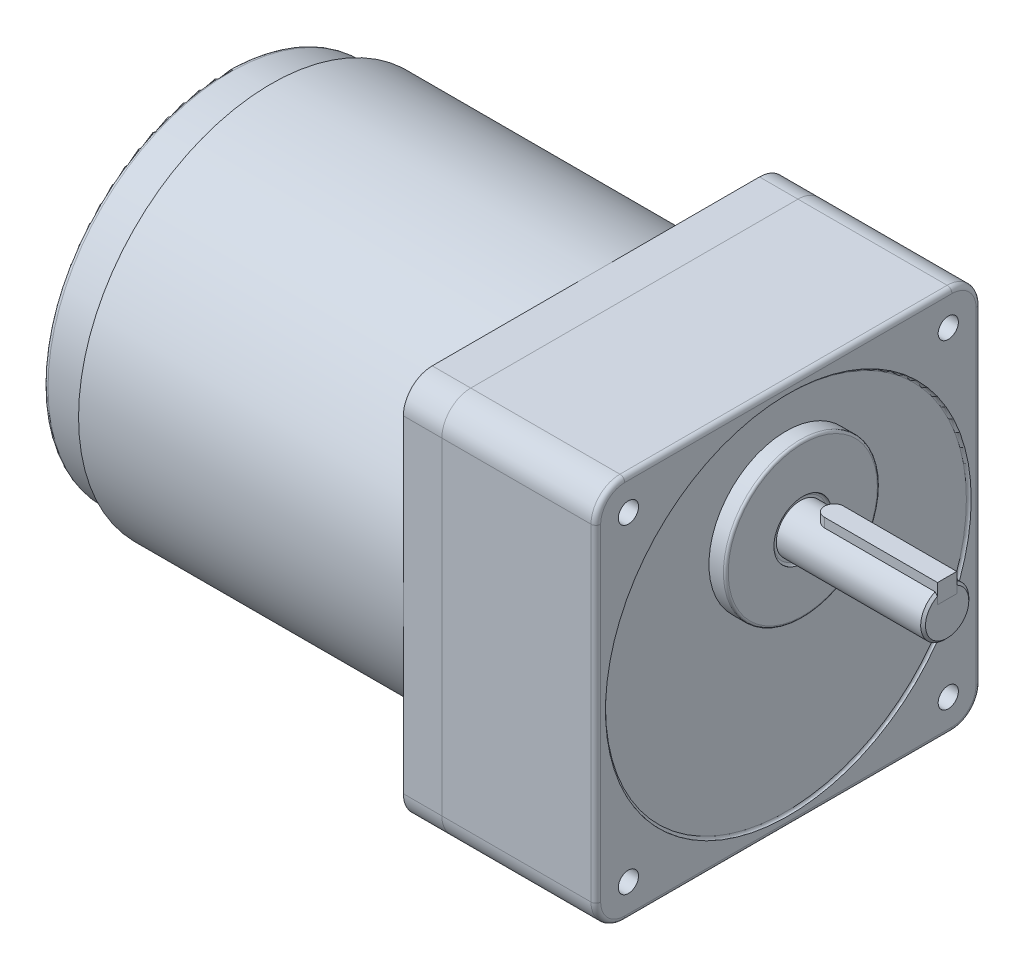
ISO-10303-21;
HEADER;
FILE_DESCRIPTION(('STEP AP214'),'2;1');
FILE_NAME('part.step','',(''),(''),'','','');
FILE_SCHEMA(('AUTOMOTIVE_DESIGN { 1 0 10303 214 1 1 1 1 }'));
ENDSEC;
DATA;
#1=APPLICATION_CONTEXT('core data for automotive mechanical design processes');
#2=APPLICATION_PROTOCOL_DEFINITION('international standard','automotive_design',2000,#1);
#3=PRODUCT_CONTEXT('',#1,'mechanical');
#4=PRODUCT('Part','Part','',(#3));
#5=PRODUCT_RELATED_PRODUCT_CATEGORY('part','',(#4));
#6=PRODUCT_DEFINITION_FORMATION('','',#4);
#7=PRODUCT_DEFINITION_CONTEXT('part definition',#1,'design');
#8=PRODUCT_DEFINITION('design','',#6,#7);
#9=PRODUCT_DEFINITION_SHAPE('','',#8);
#10=(LENGTH_UNIT() NAMED_UNIT(*) SI_UNIT(.MILLI.,.METRE.));
#11=(NAMED_UNIT(*) PLANE_ANGLE_UNIT() SI_UNIT($,.RADIAN.));
#12=(NAMED_UNIT(*) SI_UNIT($,.STERADIAN.) SOLID_ANGLE_UNIT());
#13=UNCERTAINTY_MEASURE_WITH_UNIT(LENGTH_MEASURE(1.E-05),#10,'distance_accuracy_value','');
#14=(GEOMETRIC_REPRESENTATION_CONTEXT(3) GLOBAL_UNCERTAINTY_ASSIGNED_CONTEXT((#13)) GLOBAL_UNIT_ASSIGNED_CONTEXT((#10,
#11,#12)) REPRESENTATION_CONTEXT('',''));
#15=CARTESIAN_POINT('',(0.,0.,0.));
#16=DIRECTION('',(0.,0.,1.));
#17=DIRECTION('',(1.,0.,0.));
#18=AXIS2_PLACEMENT_3D('',#15,#16,#17);
#19=CARTESIAN_POINT('',(9.5,21.5,0.));
#20=DIRECTION('',(0.,-1.,0.));
#21=DIRECTION('',(0.,0.,-1.));
#22=AXIS2_PLACEMENT_3D('',#19,#20,#21);
#23=CYLINDRICAL_SURFACE('',#22,2.);
#24=CARTESIAN_POINT('',(9.5,17.5,0.));
#25=DIRECTION('',(0.,1.,0.));
#26=DIRECTION('',(0.,0.,1.));
#27=AXIS2_PLACEMENT_3D('',#24,#25,#26);
#28=CIRCLE('',#27,2.);
#29=CARTESIAN_POINT('',(9.5,17.5,-2.));
#30=VERTEX_POINT('',#29);
#31=CARTESIAN_POINT('',(9.5,17.5,2.));
#32=VERTEX_POINT('',#31);
#33=EDGE_CURVE('E113',#30,#32,#28,.T.);
#34=ORIENTED_EDGE('',*,*,#33,.T.);
#35=DIRECTION('',(0.,-1.,0.));
#36=VECTOR('',#35,1.);
#37=CARTESIAN_POINT('',(9.5,21.5,2.));
#38=LINE('',#37,#36);
#39=CARTESIAN_POINT('',(9.5,21.5,2.));
#40=VERTEX_POINT('',#39);
#41=EDGE_CURVE('E12',#40,#32,#38,.T.);
#42=ORIENTED_EDGE('',*,*,#41,.F.);
#43=CARTESIAN_POINT('',(9.5,21.5,0.));
#44=DIRECTION('',(0.,1.,0.));
#45=DIRECTION('',(0.,0.,1.));
#46=AXIS2_PLACEMENT_3D('',#43,#44,#45);
#47=CIRCLE('',#46,2.);
#48=CARTESIAN_POINT('',(9.5,21.5,-2.));
#49=VERTEX_POINT('',#48);
#50=EDGE_CURVE('E101',#49,#40,#47,.T.);
#51=ORIENTED_EDGE('',*,*,#50,.F.);
#52=DIRECTION('',(0.,-1.,0.));
#53=VECTOR('',#52,1.);
#54=CARTESIAN_POINT('',(9.5,21.5,-2.));
#55=LINE('',#54,#53);
#56=EDGE_CURVE('E109',#49,#30,#55,.T.);
#57=ORIENTED_EDGE('',*,*,#56,.T.);
#58=EDGE_LOOP('',(#34,#42,#51,#57));
#59=FACE_BOUND('',#58,.T.);
#60=ADVANCED_FACE('F50',(#59),#23,.T.);
#61=CARTESIAN_POINT('',(33.,21.5,2.));
#62=DIRECTION('',(0.,0.,-1.));
#63=DIRECTION('',(-1.,0.,0.));
#64=AXIS2_PLACEMENT_3D('',#61,#62,#63);
#65=PLANE('',#64);
#66=DIRECTION('',(1.,0.,0.));
#67=VECTOR('',#66,1.);
#68=CARTESIAN_POINT('',(33.,17.5,2.));
#69=LINE('',#68,#67);
#70=CARTESIAN_POINT('',(33.,17.5,2.));
#71=VERTEX_POINT('',#70);
#72=EDGE_CURVE('E105',#32,#71,#69,.T.);
#73=ORIENTED_EDGE('',*,*,#72,.T.);
#74=DIRECTION('',(0.,-1.,0.));
#75=VECTOR('',#74,1.);
#76=CARTESIAN_POINT('',(33.,21.5,2.));
#77=LINE('',#76,#75);
#78=CARTESIAN_POINT('',(33.,21.5,2.));
#79=VERTEX_POINT('',#78);
#80=EDGE_CURVE('E58',#79,#71,#77,.T.);
#81=ORIENTED_EDGE('',*,*,#80,.F.);
#82=DIRECTION('',(1.,0.,0.));
#83=VECTOR('',#82,1.);
#84=CARTESIAN_POINT('',(33.,21.5,2.));
#85=LINE('',#84,#83);
#86=EDGE_CURVE('E96',#40,#79,#85,.T.);
#87=ORIENTED_EDGE('',*,*,#86,.F.);
#88=ORIENTED_EDGE('',*,*,#41,.T.);
#89=EDGE_LOOP('',(#73,#81,#87,#88));
#90=FACE_BOUND('',#89,.T.);
#91=ADVANCED_FACE('F104',(#90),#65,.F.);
#92=CARTESIAN_POINT('',(33.,21.5,-2.));
#93=DIRECTION('',(-1.,0.,0.));
#94=DIRECTION('',(0.,0.,1.));
#95=AXIS2_PLACEMENT_3D('',#92,#93,#94);
#96=PLANE('',#95);
#97=DIRECTION('',(0.,0.,-1.));
#98=VECTOR('',#97,1.);
#99=CARTESIAN_POINT('',(33.,17.5,-2.));
#100=LINE('',#99,#98);
#101=CARTESIAN_POINT('',(33.,17.5,-2.));
#102=VERTEX_POINT('',#101);
#103=EDGE_CURVE('E83',#71,#102,#100,.T.);
#104=ORIENTED_EDGE('',*,*,#103,.T.);
#105=DIRECTION('',(0.,-1.,0.));
#106=VECTOR('',#105,1.);
#107=CARTESIAN_POINT('',(33.,21.5,-2.));
#108=LINE('',#107,#106);
#109=CARTESIAN_POINT('',(33.,21.5,-2.));
#110=VERTEX_POINT('',#109);
#111=EDGE_CURVE('E106',#110,#102,#108,.T.);
#112=ORIENTED_EDGE('',*,*,#111,.F.);
#113=DIRECTION('',(0.,0.,-1.));
#114=VECTOR('',#113,1.);
#115=CARTESIAN_POINT('',(33.,21.5,-2.));
#116=LINE('',#115,#114);
#117=EDGE_CURVE('E99',#79,#110,#116,.T.);
#118=ORIENTED_EDGE('',*,*,#117,.F.);
#119=ORIENTED_EDGE('',*,*,#80,.T.);
#120=EDGE_LOOP('',(#104,#112,#118,#119));
#121=FACE_BOUND('',#120,.T.);
#122=ADVANCED_FACE('F107',(#121),#96,.F.);
#123=CARTESIAN_POINT('',(9.5,21.5,-2.));
#124=DIRECTION('',(0.,0.,1.));
#125=DIRECTION('',(1.,0.,0.));
#126=AXIS2_PLACEMENT_3D('',#123,#124,#125);
#127=PLANE('',#126);
#128=DIRECTION('',(-1.,0.,0.));
#129=VECTOR('',#128,1.);
#130=CARTESIAN_POINT('',(9.5,17.5,-2.));
#131=LINE('',#130,#129);
#132=EDGE_CURVE('E89',#102,#30,#131,.T.);
#133=ORIENTED_EDGE('',*,*,#132,.T.);
#134=ORIENTED_EDGE('',*,*,#56,.F.);
#135=DIRECTION('',(-1.,0.,0.));
#136=VECTOR('',#135,1.);
#137=CARTESIAN_POINT('',(9.5,21.5,-2.));
#138=LINE('',#137,#136);
#139=EDGE_CURVE('E66',#110,#49,#138,.T.);
#140=ORIENTED_EDGE('',*,*,#139,.F.);
#141=ORIENTED_EDGE('',*,*,#111,.T.);
#142=EDGE_LOOP('',(#133,#134,#140,#141));
#143=FACE_BOUND('',#142,.T.);
#144=ADVANCED_FACE('F120',(#143),#127,.F.);
#145=CARTESIAN_POINT('',(9.5,21.5,0.));
#146=DIRECTION('',(0.,1.,0.));
#147=DIRECTION('',(0.,0.,1.));
#148=AXIS2_PLACEMENT_3D('',#145,#146,#147);
#149=PLANE('',#148);
#150=ORIENTED_EDGE('',*,*,#50,.T.);
#151=ORIENTED_EDGE('',*,*,#86,.T.);
#152=ORIENTED_EDGE('',*,*,#117,.T.);
#153=ORIENTED_EDGE('',*,*,#139,.T.);
#154=EDGE_LOOP('',(#150,#151,#152,#153));
#155=FACE_BOUND('',#154,.T.);
#156=ADVANCED_FACE('F97',(#155),#149,.T.);
#157=CARTESIAN_POINT('',(9.5,17.5,0.));
#158=DIRECTION('',(0.,1.,0.));
#159=DIRECTION('',(0.,0.,1.));
#160=AXIS2_PLACEMENT_3D('',#157,#158,#159);
#161=PLANE('',#160);
#162=ORIENTED_EDGE('',*,*,#33,.F.);
#163=ORIENTED_EDGE('',*,*,#132,.F.);
#164=ORIENTED_EDGE('',*,*,#103,.F.);
#165=ORIENTED_EDGE('',*,*,#72,.F.);
#166=EDGE_LOOP('',(#162,#163,#164,#165));
#167=FACE_BOUND('',#166,.T.);
#168=ADVANCED_FACE('F123',(#167),#161,.F.);
#169=CLOSED_SHELL('',(#60,#91,#122,#144,#156,#168));
#170=MANIFOLD_SOLID_BREP('B2',#169);
#171=CARTESIAN_POINT('',(-107.5,0.,0.));
#172=DIRECTION('',(-1.,0.,0.));
#173=DIRECTION('',(0.,0.,1.));
#174=AXIS2_PLACEMENT_3D('',#171,#172,#173);
#175=PLANE('',#174);
#176=CARTESIAN_POINT('',(-107.5,0.,0.));
#177=DIRECTION('',(-1.,0.,0.));
#178=DIRECTION('',(0.,0.,1.));
#179=AXIS2_PLACEMENT_3D('',#176,#177,#178);
#180=CIRCLE('',#179,40.);
#181=CARTESIAN_POINT('',(-107.5,0.,40.));
#182=VERTEX_POINT('',#181);
#183=EDGE_CURVE('E289',#182,#182,#180,.T.);
#184=ORIENTED_EDGE('',*,*,#183,.T.);
#185=EDGE_LOOP('',(#184));
#186=FACE_BOUND('',#185,.T.);
#187=CARTESIAN_POINT('',(-107.5,0.,0.));
#188=DIRECTION('',(-1.,0.,0.));
#189=DIRECTION('',(0.,0.,1.));
#190=AXIS2_PLACEMENT_3D('',#187,#188,#189);
#191=CIRCLE('',#190,37.85);
#192=CARTESIAN_POINT('',(-107.5,0.,37.85));
#193=VERTEX_POINT('',#192);
#194=EDGE_CURVE('E290',#193,#193,#191,.T.);
#195=ORIENTED_EDGE('',*,*,#194,.F.);
#196=EDGE_LOOP('',(#195));
#197=FACE_BOUND('',#196,.T.);
#198=ADVANCED_FACE('F183',(#186,#197),#175,.T.);
#199=CARTESIAN_POINT('',(-40.,-34.,-34.));
#200=DIRECTION('',(1.,0.,0.));
#201=DIRECTION('',(0.,0.,-1.));
#202=AXIS2_PLACEMENT_3D('',#199,#200,#201);
#203=PLANE('',#202);
#204=CARTESIAN_POINT('',(-40.,0.,0.));
#205=DIRECTION('',(-1.,0.,0.));
#206=DIRECTION('',(0.,0.,1.));
#207=AXIS2_PLACEMENT_3D('',#204,#205,#206);
#208=CIRCLE('',#207,40.);
#209=CARTESIAN_POINT('',(-40.,0.,40.));
#210=VERTEX_POINT('',#209);
#211=CARTESIAN_POINT('',(-40.,40.,0.));
#212=VERTEX_POINT('',#211);
#213=EDGE_CURVE('E284',#210,#212,#208,.T.);
#214=ORIENTED_EDGE('',*,*,#213,.F.);
#215=DIRECTION('',(0.,1.,0.));
#216=VECTOR('',#215,1.);
#217=CARTESIAN_POINT('',(-40.,-34.,40.));
#218=LINE('',#217,#216);
#219=CARTESIAN_POINT('',(-40.,34.,40.));
#220=VERTEX_POINT('',#219);
#221=EDGE_CURVE('E273',#210,#220,#218,.T.);
#222=ORIENTED_EDGE('',*,*,#221,.T.);
#223=CARTESIAN_POINT('',(-40.,34.,34.));
#224=DIRECTION('',(-1.,0.,0.));
#225=DIRECTION('',(0.,0.,-1.));
#226=AXIS2_PLACEMENT_3D('',#223,#224,#225);
#227=CIRCLE('',#226,6.);
#228=CARTESIAN_POINT('',(-40.,40.,34.));
#229=VERTEX_POINT('',#228);
#230=EDGE_CURVE('E272',#220,#229,#227,.T.);
#231=ORIENTED_EDGE('',*,*,#230,.T.);
#232=DIRECTION('',(0.,0.,-1.));
#233=VECTOR('',#232,1.);
#234=CARTESIAN_POINT('',(-40.,40.,-34.));
#235=LINE('',#234,#233);
#236=EDGE_CURVE('E287',#229,#212,#235,.T.);
#237=ORIENTED_EDGE('',*,*,#236,.T.);
#238=EDGE_LOOP('',(#214,#222,#231,#237));
#239=FACE_BOUND('',#238,.T.);
#240=ADVANCED_FACE('F285',(#239),#203,.F.);
#241=CARTESIAN_POINT('',(-40.,0.,-40.));
#242=VERTEX_POINT('',#241);
#243=EDGE_CURVE('E206',#212,#242,#208,.T.);
#244=ORIENTED_EDGE('',*,*,#243,.F.);
#245=CARTESIAN_POINT('',(-40.,40.,-34.));
#246=VERTEX_POINT('',#245);
#247=EDGE_CURVE('E309',#212,#246,#235,.T.);
#248=ORIENTED_EDGE('',*,*,#247,.T.);
#249=CARTESIAN_POINT('',(-40.,34.,-34.));
#250=DIRECTION('',(-1.,0.,0.));
#251=DIRECTION('',(0.,0.,-1.));
#252=AXIS2_PLACEMENT_3D('',#249,#250,#251);
#253=CIRCLE('',#252,6.);
#254=CARTESIAN_POINT('',(-40.,34.,-40.));
#255=VERTEX_POINT('',#254);
#256=EDGE_CURVE('E311',#246,#255,#253,.T.);
#257=ORIENTED_EDGE('',*,*,#256,.T.);
#258=DIRECTION('',(0.,-1.,0.));
#259=VECTOR('',#258,1.);
#260=CARTESIAN_POINT('',(-40.,-34.,-40.));
#261=LINE('',#260,#259);
#262=EDGE_CURVE('E314',#255,#242,#261,.T.);
#263=ORIENTED_EDGE('',*,*,#262,.T.);
#264=EDGE_LOOP('',(#244,#248,#257,#263));
#265=FACE_BOUND('',#264,.T.);
#266=ADVANCED_FACE('F367',(#265),#203,.F.);
#267=CARTESIAN_POINT('',(-40.,-40.,0.));
#268=VERTEX_POINT('',#267);
#269=EDGE_CURVE('E198',#242,#268,#208,.T.);
#270=ORIENTED_EDGE('',*,*,#269,.F.);
#271=CARTESIAN_POINT('',(-40.,-34.,-40.));
#272=VERTEX_POINT('',#271);
#273=EDGE_CURVE('E313',#242,#272,#261,.T.);
#274=ORIENTED_EDGE('',*,*,#273,.T.);
#275=CARTESIAN_POINT('',(-40.,-34.,-34.));
#276=DIRECTION('',(-1.,0.,0.));
#277=DIRECTION('',(0.,0.,-1.));
#278=AXIS2_PLACEMENT_3D('',#275,#276,#277);
#279=CIRCLE('',#278,6.);
#280=CARTESIAN_POINT('',(-40.,-40.,-34.));
#281=VERTEX_POINT('',#280);
#282=EDGE_CURVE('E300',#272,#281,#279,.T.);
#283=ORIENTED_EDGE('',*,*,#282,.T.);
#284=DIRECTION('',(0.,0.,1.));
#285=VECTOR('',#284,1.);
#286=CARTESIAN_POINT('',(-40.,-40.,-34.));
#287=LINE('',#286,#285);
#288=EDGE_CURVE('E305',#281,#268,#287,.T.);
#289=ORIENTED_EDGE('',*,*,#288,.T.);
#290=EDGE_LOOP('',(#270,#274,#283,#289));
#291=FACE_BOUND('',#290,.T.);
#292=ADVANCED_FACE('F411',(#291),#203,.F.);
#293=EDGE_CURVE('E265',#268,#210,#208,.T.);
#294=ORIENTED_EDGE('',*,*,#293,.F.);
#295=CARTESIAN_POINT('',(-40.,-40.,34.));
#296=VERTEX_POINT('',#295);
#297=EDGE_CURVE('E303',#268,#296,#287,.T.);
#298=ORIENTED_EDGE('',*,*,#297,.T.);
#299=CARTESIAN_POINT('',(-40.,-34.,34.));
#300=DIRECTION('',(-1.,0.,0.));
#301=DIRECTION('',(0.,0.,1.));
#302=AXIS2_PLACEMENT_3D('',#299,#300,#301);
#303=CIRCLE('',#302,6.);
#304=CARTESIAN_POINT('',(-40.,-34.,40.));
#305=VERTEX_POINT('',#304);
#306=EDGE_CURVE('E268',#296,#305,#303,.T.);
#307=ORIENTED_EDGE('',*,*,#306,.T.);
#308=EDGE_CURVE('E261',#305,#210,#218,.T.);
#309=ORIENTED_EDGE('',*,*,#308,.T.);
#310=EDGE_LOOP('',(#294,#298,#307,#309));
#311=FACE_BOUND('',#310,.T.);
#312=ADVANCED_FACE('F263',(#311),#203,.F.);
#313=CARTESIAN_POINT('',(-40.,-34.,-34.));
#314=DIRECTION('',(1.,0.,0.));
#315=DIRECTION('',(0.,0.,-1.));
#316=AXIS2_PLACEMENT_3D('',#313,#314,#315);
#317=CYLINDRICAL_SURFACE('',#316,6.);
#318=CARTESIAN_POINT('',(-32.,-34.,-34.));
#319=DIRECTION('',(-1.,0.,0.));
#320=DIRECTION('',(0.,0.,-1.));
#321=AXIS2_PLACEMENT_3D('',#318,#319,#320);
#322=CIRCLE('',#321,6.);
#323=CARTESIAN_POINT('',(-32.,-34.,-40.));
#324=VERTEX_POINT('',#323);
#325=CARTESIAN_POINT('',(-32.,-40.,-34.));
#326=VERTEX_POINT('',#325);
#327=EDGE_CURVE('E317',#324,#326,#322,.T.);
#328=ORIENTED_EDGE('',*,*,#327,.T.);
#329=DIRECTION('',(1.,0.,0.));
#330=VECTOR('',#329,1.);
#331=CARTESIAN_POINT('',(-40.,-40.,-34.));
#332=LINE('',#331,#330);
#333=EDGE_CURVE('E293',#281,#326,#332,.T.);
#334=ORIENTED_EDGE('',*,*,#333,.F.);
#335=ORIENTED_EDGE('',*,*,#282,.F.);
#336=DIRECTION('',(1.,0.,0.));
#337=VECTOR('',#336,1.);
#338=CARTESIAN_POINT('',(-40.,-34.,-40.));
#339=LINE('',#338,#337);
#340=EDGE_CURVE('E316',#272,#324,#339,.T.);
#341=ORIENTED_EDGE('',*,*,#340,.T.);
#342=EDGE_LOOP('',(#328,#334,#335,#341));
#343=FACE_BOUND('',#342,.T.);
#344=ADVANCED_FACE('F404',(#343),#317,.T.);
#345=CARTESIAN_POINT('',(-40.,-40.,-34.));
#346=DIRECTION('',(0.,1.,0.));
#347=DIRECTION('',(0.,0.,1.));
#348=AXIS2_PLACEMENT_3D('',#345,#346,#347);
#349=PLANE('',#348);
#350=DIRECTION('',(0.,0.,1.));
#351=VECTOR('',#350,1.);
#352=CARTESIAN_POINT('',(-32.,-40.,-34.));
#353=LINE('',#352,#351);
#354=CARTESIAN_POINT('',(-32.,-40.,34.));
#355=VERTEX_POINT('',#354);
#356=EDGE_CURVE('E320',#326,#355,#353,.T.);
#357=ORIENTED_EDGE('',*,*,#356,.T.);
#358=DIRECTION('',(1.,0.,0.));
#359=VECTOR('',#358,1.);
#360=CARTESIAN_POINT('',(-40.,-40.,34.));
#361=LINE('',#360,#359);
#362=EDGE_CURVE('E295',#296,#355,#361,.T.);
#363=ORIENTED_EDGE('',*,*,#362,.F.);
#364=ORIENTED_EDGE('',*,*,#297,.F.);
#365=ORIENTED_EDGE('',*,*,#288,.F.);
#366=ORIENTED_EDGE('',*,*,#333,.T.);
#367=EDGE_LOOP('',(#357,#363,#364,#365,#366));
#368=FACE_BOUND('',#367,.T.);
#369=ADVANCED_FACE('F401',(#368),#349,.F.);
#370=CARTESIAN_POINT('',(-40.,-34.,34.));
#371=DIRECTION('',(1.,0.,0.));
#372=DIRECTION('',(0.,0.,-1.));
#373=AXIS2_PLACEMENT_3D('',#370,#371,#372);
#374=CYLINDRICAL_SURFACE('',#373,6.);
#375=CARTESIAN_POINT('',(-32.,-34.,34.));
#376=DIRECTION('',(-1.,0.,0.));
#377=DIRECTION('',(0.,0.,1.));
#378=AXIS2_PLACEMENT_3D('',#375,#376,#377);
#379=CIRCLE('',#378,6.);
#380=CARTESIAN_POINT('',(-32.,-34.,40.));
#381=VERTEX_POINT('',#380);
#382=EDGE_CURVE('E322',#355,#381,#379,.T.);
#383=ORIENTED_EDGE('',*,*,#382,.T.);
#384=DIRECTION('',(1.,0.,0.));
#385=VECTOR('',#384,1.);
#386=CARTESIAN_POINT('',(-40.,-34.,40.));
#387=LINE('',#386,#385);
#388=EDGE_CURVE('E345',#305,#381,#387,.T.);
#389=ORIENTED_EDGE('',*,*,#388,.F.);
#390=ORIENTED_EDGE('',*,*,#306,.F.);
#391=ORIENTED_EDGE('',*,*,#362,.T.);
#392=EDGE_LOOP('',(#383,#389,#390,#391));
#393=FACE_BOUND('',#392,.T.);
#394=ADVANCED_FACE('F398',(#393),#374,.T.);
#395=CARTESIAN_POINT('',(-40.,-34.,40.));
#396=DIRECTION('',(0.,0.,-1.));
#397=DIRECTION('',(-1.,0.,0.));
#398=AXIS2_PLACEMENT_3D('',#395,#396,#397);
#399=PLANE('',#398);
#400=DIRECTION('',(0.,1.,0.));
#401=VECTOR('',#400,1.);
#402=CARTESIAN_POINT('',(-32.,-34.,40.));
#403=LINE('',#402,#401);
#404=CARTESIAN_POINT('',(-32.,34.,40.));
#405=VERTEX_POINT('',#404);
#406=EDGE_CURVE('E324',#381,#405,#403,.T.);
#407=ORIENTED_EDGE('',*,*,#406,.T.);
#408=DIRECTION('',(1.,0.,0.));
#409=VECTOR('',#408,1.);
#410=CARTESIAN_POINT('',(-40.,34.,40.));
#411=LINE('',#410,#409);
#412=EDGE_CURVE('E279',#220,#405,#411,.T.);
#413=ORIENTED_EDGE('',*,*,#412,.F.);
#414=ORIENTED_EDGE('',*,*,#221,.F.);
#415=ORIENTED_EDGE('',*,*,#308,.F.);
#416=ORIENTED_EDGE('',*,*,#388,.T.);
#417=EDGE_LOOP('',(#407,#413,#414,#415,#416));
#418=FACE_BOUND('',#417,.T.);
#419=ADVANCED_FACE('F277',(#418),#399,.F.);
#420=CARTESIAN_POINT('',(-40.,34.,34.));
#421=DIRECTION('',(1.,0.,0.));
#422=DIRECTION('',(0.,0.,-1.));
#423=AXIS2_PLACEMENT_3D('',#420,#421,#422);
#424=CYLINDRICAL_SURFACE('',#423,6.);
#425=CARTESIAN_POINT('',(-32.,34.,34.));
#426=DIRECTION('',(-1.,0.,0.));
#427=DIRECTION('',(0.,0.,-1.));
#428=AXIS2_PLACEMENT_3D('',#425,#426,#427);
#429=CIRCLE('',#428,6.);
#430=CARTESIAN_POINT('',(-32.,40.,34.));
#431=VERTEX_POINT('',#430);
#432=EDGE_CURVE('E326',#405,#431,#429,.T.);
#433=ORIENTED_EDGE('',*,*,#432,.T.);
#434=DIRECTION('',(1.,0.,0.));
#435=VECTOR('',#434,1.);
#436=CARTESIAN_POINT('',(-40.,40.,34.));
#437=LINE('',#436,#435);
#438=EDGE_CURVE('E341',#229,#431,#437,.T.);
#439=ORIENTED_EDGE('',*,*,#438,.F.);
#440=ORIENTED_EDGE('',*,*,#230,.F.);
#441=ORIENTED_EDGE('',*,*,#412,.T.);
#442=EDGE_LOOP('',(#433,#439,#440,#441));
#443=FACE_BOUND('',#442,.T.);
#444=ADVANCED_FACE('F391',(#443),#424,.T.);
#445=CARTESIAN_POINT('',(-40.,40.,-34.));
#446=DIRECTION('',(0.,-1.,0.));
#447=DIRECTION('',(0.,0.,-1.));
#448=AXIS2_PLACEMENT_3D('',#445,#446,#447);
#449=PLANE('',#448);
#450=DIRECTION('',(0.,0.,-1.));
#451=VECTOR('',#450,1.);
#452=CARTESIAN_POINT('',(-32.,40.,-34.));
#453=LINE('',#452,#451);
#454=CARTESIAN_POINT('',(-32.,40.,-34.));
#455=VERTEX_POINT('',#454);
#456=EDGE_CURVE('E328',#431,#455,#453,.T.);
#457=ORIENTED_EDGE('',*,*,#456,.T.);
#458=DIRECTION('',(1.,0.,0.));
#459=VECTOR('',#458,1.);
#460=CARTESIAN_POINT('',(-40.,40.,-34.));
#461=LINE('',#460,#459);
#462=EDGE_CURVE('E338',#246,#455,#461,.T.);
#463=ORIENTED_EDGE('',*,*,#462,.F.);
#464=ORIENTED_EDGE('',*,*,#247,.F.);
#465=ORIENTED_EDGE('',*,*,#236,.F.);
#466=ORIENTED_EDGE('',*,*,#438,.T.);
#467=EDGE_LOOP('',(#457,#463,#464,#465,#466));
#468=FACE_BOUND('',#467,.T.);
#469=ADVANCED_FACE('F387',(#468),#449,.F.);
#470=CARTESIAN_POINT('',(-40.,34.,-34.));
#471=DIRECTION('',(1.,0.,0.));
#472=DIRECTION('',(0.,0.,-1.));
#473=AXIS2_PLACEMENT_3D('',#470,#471,#472);
#474=CYLINDRICAL_SURFACE('',#473,6.);
#475=CARTESIAN_POINT('',(-32.,34.,-34.));
#476=DIRECTION('',(-1.,0.,0.));
#477=DIRECTION('',(0.,0.,-1.));
#478=AXIS2_PLACEMENT_3D('',#475,#476,#477);
#479=CIRCLE('',#478,6.);
#480=CARTESIAN_POINT('',(-32.,34.,-40.));
#481=VERTEX_POINT('',#480);
#482=EDGE_CURVE('E330',#455,#481,#479,.T.);
#483=ORIENTED_EDGE('',*,*,#482,.T.);
#484=DIRECTION('',(1.,0.,0.));
#485=VECTOR('',#484,1.);
#486=CARTESIAN_POINT('',(-40.,34.,-40.));
#487=LINE('',#486,#485);
#488=EDGE_CURVE('E335',#255,#481,#487,.T.);
#489=ORIENTED_EDGE('',*,*,#488,.F.);
#490=ORIENTED_EDGE('',*,*,#256,.F.);
#491=ORIENTED_EDGE('',*,*,#462,.T.);
#492=EDGE_LOOP('',(#483,#489,#490,#491));
#493=FACE_BOUND('',#492,.T.);
#494=ADVANCED_FACE('F383',(#493),#474,.T.);
#495=CARTESIAN_POINT('',(-40.,-34.,-40.));
#496=DIRECTION('',(0.,0.,1.));
#497=DIRECTION('',(1.,0.,0.));
#498=AXIS2_PLACEMENT_3D('',#495,#496,#497);
#499=PLANE('',#498);
#500=DIRECTION('',(0.,-1.,0.));
#501=VECTOR('',#500,1.);
#502=CARTESIAN_POINT('',(-32.,-34.,-40.));
#503=LINE('',#502,#501);
#504=EDGE_CURVE('E304',#481,#324,#503,.T.);
#505=ORIENTED_EDGE('',*,*,#504,.T.);
#506=ORIENTED_EDGE('',*,*,#340,.F.);
#507=ORIENTED_EDGE('',*,*,#273,.F.);
#508=ORIENTED_EDGE('',*,*,#262,.F.);
#509=ORIENTED_EDGE('',*,*,#488,.T.);
#510=EDGE_LOOP('',(#505,#506,#507,#508,#509));
#511=FACE_BOUND('',#510,.T.);
#512=ADVANCED_FACE('F379',(#511),#499,.F.);
#513=CARTESIAN_POINT('',(-32.,-34.,-34.));
#514=DIRECTION('',(1.,0.,0.));
#515=DIRECTION('',(0.,0.,-1.));
#516=AXIS2_PLACEMENT_3D('',#513,#514,#515);
#517=PLANE('',#516);
#518=ORIENTED_EDGE('',*,*,#327,.F.);
#519=ORIENTED_EDGE('',*,*,#504,.F.);
#520=ORIENTED_EDGE('',*,*,#482,.F.);
#521=ORIENTED_EDGE('',*,*,#456,.F.);
#522=ORIENTED_EDGE('',*,*,#432,.F.);
#523=ORIENTED_EDGE('',*,*,#406,.F.);
#524=ORIENTED_EDGE('',*,*,#382,.F.);
#525=ORIENTED_EDGE('',*,*,#356,.F.);
#526=EDGE_LOOP('',(#518,#519,#520,#521,#522,#523,#524,#525));
#527=FACE_BOUND('',#526,.T.);
#528=ADVANCED_FACE('F374',(#527),#517,.T.);
#529=CARTESIAN_POINT('',(-107.5,0.,0.));
#530=DIRECTION('',(1.,0.,0.));
#531=DIRECTION('',(0.,0.,-1.));
#532=AXIS2_PLACEMENT_3D('',#529,#530,#531);
#533=CYLINDRICAL_SURFACE('',#532,40.);
#534=ORIENTED_EDGE('',*,*,#183,.F.);
#535=EDGE_LOOP('',(#534));
#536=FACE_BOUND('',#535,.T.);
#537=ORIENTED_EDGE('',*,*,#213,.T.);
#538=ORIENTED_EDGE('',*,*,#243,.T.);
#539=ORIENTED_EDGE('',*,*,#269,.T.);
#540=ORIENTED_EDGE('',*,*,#293,.T.);
#541=EDGE_LOOP('',(#537,#538,#539,#540));
#542=FACE_BOUND('',#541,.T.);
#543=ADVANCED_FACE('F292',(#536,#542),#533,.T.);
#544=CARTESIAN_POINT('',(-117.,0.,0.));
#545=DIRECTION('',(1.,0.,0.));
#546=DIRECTION('',(0.,0.,-1.));
#547=AXIS2_PLACEMENT_3D('',#544,#545,#546);
#548=CYLINDRICAL_SURFACE('',#547,37.85);
#549=CARTESIAN_POINT('',(-116.,0.,0.));
#550=DIRECTION('',(-1.,0.,0.));
#551=DIRECTION('',(0.,0.,1.));
#552=AXIS2_PLACEMENT_3D('',#549,#550,#551);
#553=CIRCLE('',#552,37.85);
#554=CARTESIAN_POINT('',(-116.,0.,37.85));
#555=VERTEX_POINT('',#554);
#556=EDGE_CURVE('E48',#555,#555,#553,.F.);
#557=ORIENTED_EDGE('',*,*,#556,.T.);
#558=EDGE_LOOP('',(#557));
#559=FACE_BOUND('',#558,.T.);
#560=ORIENTED_EDGE('',*,*,#194,.T.);
#561=EDGE_LOOP('',(#560));
#562=FACE_BOUND('',#561,.T.);
#563=ADVANCED_FACE('F358',(#559,#562),#548,.T.);
#564=CARTESIAN_POINT('',(-117.,0.,0.));
#565=DIRECTION('',(-1.,0.,0.));
#566=DIRECTION('',(0.,0.,1.));
#567=AXIS2_PLACEMENT_3D('',#564,#565,#566);
#568=PLANE('',#567);
#569=CARTESIAN_POINT('',(-117.,0.,0.));
#570=DIRECTION('',(-1.,0.,0.));
#571=DIRECTION('',(0.,0.,1.));
#572=AXIS2_PLACEMENT_3D('',#569,#570,#571);
#573=CIRCLE('',#572,36.85);
#574=CARTESIAN_POINT('',(-117.,0.,36.85));
#575=VERTEX_POINT('',#574);
#576=EDGE_CURVE('E191',#575,#575,#573,.T.);
#577=ORIENTED_EDGE('',*,*,#576,.T.);
#578=EDGE_LOOP('',(#577));
#579=FACE_BOUND('',#578,.T.);
#580=ADVANCED_FACE('F351',(#579),#568,.T.);
#581=CARTESIAN_POINT('',(-116.,0.,0.));
#582=DIRECTION('',(-1.,0.,0.));
#583=DIRECTION('',(0.,0.,1.));
#584=AXIS2_PLACEMENT_3D('',#581,#582,#583);
#585=TOROIDAL_SURFACE('',#584,36.85,1.);
#586=ORIENTED_EDGE('',*,*,#556,.F.);
#587=EDGE_LOOP('',(#586));
#588=FACE_BOUND('',#587,.T.);
#589=ORIENTED_EDGE('',*,*,#576,.F.);
#590=EDGE_LOOP('',(#589));
#591=FACE_BOUND('',#590,.T.);
#592=ADVANCED_FACE('F185',(#588,#591),#585,.T.);
#593=CLOSED_SHELL('',(#198,#240,#266,#292,#312,#344,#369,#394,#419,#444,#469,#494,#512,#528,
#543,#563,#580,#592));
#594=MANIFOLD_SOLID_BREP('B6',#593);
#595=CARTESIAN_POINT('',(2.5,15.,0.));
#596=DIRECTION('',(1.,0.,0.));
#597=DIRECTION('',(0.,0.,-1.));
#598=AXIS2_PLACEMENT_3D('',#595,#596,#597);
#599=PLANE('',#598);
#600=CARTESIAN_POINT('',(2.5,15.,0.));
#601=DIRECTION('',(1.,0.,0.));
#602=DIRECTION('',(0.,0.,-1.));
#603=AXIS2_PLACEMENT_3D('',#600,#601,#602);
#604=CIRCLE('',#603,5.5);
#605=CARTESIAN_POINT('',(2.5,15.,-5.5));
#606=VERTEX_POINT('',#605);
#607=EDGE_CURVE('E861',#606,#606,#604,.T.);
#608=ORIENTED_EDGE('',*,*,#607,.T.);
#609=EDGE_LOOP('',(#608));
#610=FACE_BOUND('',#609,.T.);
#611=CARTESIAN_POINT('',(2.5,15.,0.));
#612=DIRECTION('',(1.,0.,0.));
#613=DIRECTION('',(0.,0.,-1.));
#614=AXIS2_PLACEMENT_3D('',#611,#612,#613);
#615=CIRCLE('',#614,5.);
#616=CARTESIAN_POINT('',(2.5,15.,-5.));
#617=VERTEX_POINT('',#616);
#618=EDGE_CURVE('E712',#617,#617,#615,.T.);
#619=ORIENTED_EDGE('',*,*,#618,.F.);
#620=EDGE_LOOP('',(#619));
#621=FACE_BOUND('',#620,.T.);
#622=ADVANCED_FACE('F541',(#610,#621),#599,.T.);
#623=CARTESIAN_POINT('',(-0.5,0.,0.));
#624=DIRECTION('',(1.,0.,0.));
#625=DIRECTION('',(0.,0.,-1.));
#626=AXIS2_PLACEMENT_3D('',#623,#624,#625);
#627=PLANE('',#626);
#628=CARTESIAN_POINT('',(-0.5,0.,0.));
#629=DIRECTION('',(1.,0.,0.));
#630=DIRECTION('',(0.,0.,-1.));
#631=AXIS2_PLACEMENT_3D('',#628,#629,#630);
#632=CIRCLE('',#631,37.5);
#633=CARTESIAN_POINT('',(-0.5,0.,-37.5));
#634=VERTEX_POINT('',#633);
#635=EDGE_CURVE('E832',#634,#634,#632,.T.);
#636=ORIENTED_EDGE('',*,*,#635,.T.);
#637=EDGE_LOOP('',(#636));
#638=FACE_BOUND('',#637,.T.);
#639=CARTESIAN_POINT('',(-0.5,15.,0.));
#640=DIRECTION('',(1.,0.,0.));
#641=DIRECTION('',(0.,0.,-1.));
#642=AXIS2_PLACEMENT_3D('',#639,#640,#641);
#643=CIRCLE('',#642,16.);
#644=CARTESIAN_POINT('',(-0.5,15.,-16.));
#645=VERTEX_POINT('',#644);
#646=EDGE_CURVE('E718',#645,#645,#643,.T.);
#647=ORIENTED_EDGE('',*,*,#646,.F.);
#648=EDGE_LOOP('',(#647));
#649=FACE_BOUND('',#648,.T.);
#650=ADVANCED_FACE('F889',(#638,#649),#627,.T.);
#651=CARTESIAN_POINT('',(0.,-34.,34.));
#652=DIRECTION('',(-1.,0.,0.));
#653=DIRECTION('',(0.,0.,1.));
#654=AXIS2_PLACEMENT_3D('',#651,#652,#653);
#655=PLANE('',#654);
#656=CARTESIAN_POINT('',(0.,0.,0.));
#657=DIRECTION('',(1.,0.,0.));
#658=DIRECTION('',(0.,0.,-1.));
#659=AXIS2_PLACEMENT_3D('',#656,#657,#658);
#660=CIRCLE('',#659,38.);
#661=CARTESIAN_POINT('',(0.,0.,-38.));
#662=VERTEX_POINT('',#661);
#663=EDGE_CURVE('E721',#662,#662,#660,.T.);
#664=ORIENTED_EDGE('',*,*,#663,.F.);
#665=EDGE_LOOP('',(#664));
#666=FACE_BOUND('',#665,.T.);
#667=CARTESIAN_POINT('',(0.,33.2340187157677,33.2340187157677));
#668=DIRECTION('',(1.,0.,0.));
#669=DIRECTION('',(0.,0.,-1.));
#670=AXIS2_PLACEMENT_3D('',#667,#668,#669);
#671=CIRCLE('',#670,2.09999999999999);
#672=CARTESIAN_POINT('',(0.,33.2340187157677,31.1340187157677));
#673=VERTEX_POINT('',#672);
#674=EDGE_CURVE('E724',#673,#673,#671,.T.);
#675=ORIENTED_EDGE('',*,*,#674,.F.);
#676=EDGE_LOOP('',(#675));
#677=FACE_BOUND('',#676,.T.);
#678=CARTESIAN_POINT('',(0.,-33.2340187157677,33.2340187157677));
#679=DIRECTION('',(1.,0.,0.));
#680=DIRECTION('',(0.,0.,-1.));
#681=AXIS2_PLACEMENT_3D('',#678,#679,#680);
#682=CIRCLE('',#681,2.09999999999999);
#683=CARTESIAN_POINT('',(0.,-33.2340187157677,31.1340187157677));
#684=VERTEX_POINT('',#683);
#685=EDGE_CURVE('E730',#684,#684,#682,.T.);
#686=ORIENTED_EDGE('',*,*,#685,.F.);
#687=EDGE_LOOP('',(#686));
#688=FACE_BOUND('',#687,.T.);
#689=CARTESIAN_POINT('',(0.,34.,34.));
#690=DIRECTION('',(-1.,0.,0.));
#691=DIRECTION('',(0.,0.,1.));
#692=AXIS2_PLACEMENT_3D('',#689,#690,#691);
#693=CIRCLE('',#692,5.);
#694=CARTESIAN_POINT('',(0.,39.,34.));
#695=VERTEX_POINT('',#694);
#696=CARTESIAN_POINT('',(0.,34.,39.));
#697=VERTEX_POINT('',#696);
#698=EDGE_CURVE('E810',#695,#697,#693,.F.);
#699=ORIENTED_EDGE('',*,*,#698,.T.);
#700=DIRECTION('',(0.,-1.,0.));
#701=VECTOR('',#700,1.);
#702=CARTESIAN_POINT('',(0.,-34.,39.));
#703=LINE('',#702,#701);
#704=CARTESIAN_POINT('',(0.,-34.,39.));
#705=VERTEX_POINT('',#704);
#706=EDGE_CURVE('E812',#697,#705,#703,.T.);
#707=ORIENTED_EDGE('',*,*,#706,.T.);
#708=CARTESIAN_POINT('',(0.,-34.,34.));
#709=DIRECTION('',(-1.,0.,0.));
#710=DIRECTION('',(0.,0.,1.));
#711=AXIS2_PLACEMENT_3D('',#708,#709,#710);
#712=CIRCLE('',#711,5.);
#713=CARTESIAN_POINT('',(0.,-39.,34.));
#714=VERTEX_POINT('',#713);
#715=EDGE_CURVE('E778',#705,#714,#712,.F.);
#716=ORIENTED_EDGE('',*,*,#715,.T.);
#717=DIRECTION('',(0.,0.,-1.));
#718=VECTOR('',#717,1.);
#719=CARTESIAN_POINT('',(0.,-39.,-34.));
#720=LINE('',#719,#718);
#721=CARTESIAN_POINT('',(0.,-39.,-34.));
#722=VERTEX_POINT('',#721);
#723=EDGE_CURVE('E800',#714,#722,#720,.T.);
#724=ORIENTED_EDGE('',*,*,#723,.T.);
#725=CARTESIAN_POINT('',(0.,-34.,-34.));
#726=DIRECTION('',(-1.,0.,0.));
#727=DIRECTION('',(0.,0.,1.));
#728=AXIS2_PLACEMENT_3D('',#725,#726,#727);
#729=CIRCLE('',#728,5.);
#730=CARTESIAN_POINT('',(0.,-34.,-39.));
#731=VERTEX_POINT('',#730);
#732=EDGE_CURVE('E802',#722,#731,#729,.F.);
#733=ORIENTED_EDGE('',*,*,#732,.T.);
#734=DIRECTION('',(0.,1.,0.));
#735=VECTOR('',#734,1.);
#736=CARTESIAN_POINT('',(0.,34.,-39.));
#737=LINE('',#736,#735);
#738=CARTESIAN_POINT('',(0.,34.,-39.));
#739=VERTEX_POINT('',#738);
#740=EDGE_CURVE('E804',#731,#739,#737,.T.);
#741=ORIENTED_EDGE('',*,*,#740,.T.);
#742=CARTESIAN_POINT('',(0.,34.,-34.));
#743=DIRECTION('',(-1.,0.,0.));
#744=DIRECTION('',(0.,0.,1.));
#745=AXIS2_PLACEMENT_3D('',#742,#743,#744);
#746=CIRCLE('',#745,5.);
#747=CARTESIAN_POINT('',(0.,39.,-34.));
#748=VERTEX_POINT('',#747);
#749=EDGE_CURVE('E806',#739,#748,#746,.F.);
#750=ORIENTED_EDGE('',*,*,#749,.T.);
#751=DIRECTION('',(0.,0.,1.));
#752=VECTOR('',#751,1.);
#753=CARTESIAN_POINT('',(0.,39.,34.));
#754=LINE('',#753,#752);
#755=EDGE_CURVE('E808',#748,#695,#754,.T.);
#756=ORIENTED_EDGE('',*,*,#755,.T.);
#757=EDGE_LOOP('',(#699,#707,#716,#724,#733,#741,#750,#756));
#758=FACE_BOUND('',#757,.T.);
#759=CARTESIAN_POINT('',(0.,33.2340187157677,-33.2340187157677));
#760=DIRECTION('',(1.,0.,0.));
#761=DIRECTION('',(0.,0.,-1.));
#762=AXIS2_PLACEMENT_3D('',#759,#760,#761);
#763=CIRCLE('',#762,2.09999999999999);
#764=CARTESIAN_POINT('',(0.,33.2340187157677,-35.3340187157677));
#765=VERTEX_POINT('',#764);
#766=EDGE_CURVE('E742',#765,#765,#763,.T.);
#767=ORIENTED_EDGE('',*,*,#766,.F.);
#768=EDGE_LOOP('',(#767));
#769=FACE_BOUND('',#768,.T.);
#770=CARTESIAN_POINT('',(0.,-33.2340187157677,-33.2340187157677));
#771=DIRECTION('',(1.,0.,0.));
#772=DIRECTION('',(0.,0.,-1.));
#773=AXIS2_PLACEMENT_3D('',#770,#771,#772);
#774=CIRCLE('',#773,2.09999999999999);
#775=CARTESIAN_POINT('',(0.,-33.2340187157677,-35.3340187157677));
#776=VERTEX_POINT('',#775);
#777=EDGE_CURVE('E736',#776,#776,#774,.T.);
#778=ORIENTED_EDGE('',*,*,#777,.F.);
#779=EDGE_LOOP('',(#778));
#780=FACE_BOUND('',#779,.T.);
#781=ADVANCED_FACE('F894',(#666,#677,#688,#758,#769,#780),#655,.F.);
#782=CARTESIAN_POINT('',(-32.,-34.,34.));
#783=DIRECTION('',(1.,0.,0.));
#784=DIRECTION('',(0.,0.,-1.));
#785=AXIS2_PLACEMENT_3D('',#782,#783,#784);
#786=CYLINDRICAL_SURFACE('',#785,6.);
#787=DIRECTION('',(1.,0.,0.));
#788=VECTOR('',#787,1.);
#789=CARTESIAN_POINT('',(-32.,-40.,34.));
#790=LINE('',#789,#788);
#791=CARTESIAN_POINT('',(-32.,-40.,34.));
#792=VERTEX_POINT('',#791);
#793=CARTESIAN_POINT('',(-1.,-40.,34.));
#794=VERTEX_POINT('',#793);
#795=EDGE_CURVE('E774',#792,#794,#790,.T.);
#796=ORIENTED_EDGE('',*,*,#795,.T.);
#797=CARTESIAN_POINT('',(-1.,-34.,34.));
#798=DIRECTION('',(-1.,0.,0.));
#799=DIRECTION('',(0.,0.,1.));
#800=AXIS2_PLACEMENT_3D('',#797,#798,#799);
#801=CIRCLE('',#800,6.);
#802=CARTESIAN_POINT('',(-1.,-34.,40.));
#803=VERTEX_POINT('',#802);
#804=EDGE_CURVE('E830',#794,#803,#801,.T.);
#805=ORIENTED_EDGE('',*,*,#804,.T.);
#806=DIRECTION('',(1.,0.,0.));
#807=VECTOR('',#806,1.);
#808=CARTESIAN_POINT('',(-32.,-34.,40.));
#809=LINE('',#808,#807);
#810=CARTESIAN_POINT('',(-32.,-34.,40.));
#811=VERTEX_POINT('',#810);
#812=EDGE_CURVE('E775',#811,#803,#809,.T.);
#813=ORIENTED_EDGE('',*,*,#812,.F.);
#814=CARTESIAN_POINT('',(-32.,-34.,34.));
#815=DIRECTION('',(1.,0.,0.));
#816=DIRECTION('',(0.,0.,1.));
#817=AXIS2_PLACEMENT_3D('',#814,#815,#816);
#818=CIRCLE('',#817,6.);
#819=EDGE_CURVE('E749',#811,#792,#818,.T.);
#820=ORIENTED_EDGE('',*,*,#819,.T.);
#821=EDGE_LOOP('',(#796,#805,#813,#820));
#822=FACE_BOUND('',#821,.T.);
#823=ADVANCED_FACE('F950',(#822),#786,.T.);
#824=CARTESIAN_POINT('',(-32.,-34.,40.));
#825=DIRECTION('',(0.,0.,1.));
#826=DIRECTION('',(1.,0.,0.));
#827=AXIS2_PLACEMENT_3D('',#824,#825,#826);
#828=PLANE('',#827);
#829=ORIENTED_EDGE('',*,*,#812,.T.);
#830=DIRECTION('',(0.,-1.,0.));
#831=VECTOR('',#830,1.);
#832=CARTESIAN_POINT('',(-1.,34.,40.));
#833=LINE('',#832,#831);
#834=CARTESIAN_POINT('',(-1.,34.,40.));
#835=VERTEX_POINT('',#834);
#836=EDGE_CURVE('E815',#803,#835,#833,.F.);
#837=ORIENTED_EDGE('',*,*,#836,.T.);
#838=DIRECTION('',(1.,0.,0.));
#839=VECTOR('',#838,1.);
#840=CARTESIAN_POINT('',(-32.,34.,40.));
#841=LINE('',#840,#839);
#842=CARTESIAN_POINT('',(-32.,34.,40.));
#843=VERTEX_POINT('',#842);
#844=EDGE_CURVE('E779',#843,#835,#841,.T.);
#845=ORIENTED_EDGE('',*,*,#844,.F.);
#846=DIRECTION('',(0.,-1.,0.));
#847=VECTOR('',#846,1.);
#848=CARTESIAN_POINT('',(-32.,-34.,40.));
#849=LINE('',#848,#847);
#850=EDGE_CURVE('E771',#843,#811,#849,.T.);
#851=ORIENTED_EDGE('',*,*,#850,.T.);
#852=EDGE_LOOP('',(#829,#837,#845,#851));
#853=FACE_BOUND('',#852,.T.);
#854=ADVANCED_FACE('F952',(#853),#828,.T.);
#855=CARTESIAN_POINT('',(-32.,34.,34.));
#856=DIRECTION('',(1.,0.,0.));
#857=DIRECTION('',(0.,0.,-1.));
#858=AXIS2_PLACEMENT_3D('',#855,#856,#857);
#859=CYLINDRICAL_SURFACE('',#858,6.);
#860=ORIENTED_EDGE('',*,*,#844,.T.);
#861=CARTESIAN_POINT('',(-1.,34.,34.));
#862=DIRECTION('',(-1.,0.,0.));
#863=DIRECTION('',(0.,0.,1.));
#864=AXIS2_PLACEMENT_3D('',#861,#862,#863);
#865=CIRCLE('',#864,6.);
#866=CARTESIAN_POINT('',(-1.,40.,34.));
#867=VERTEX_POINT('',#866);
#868=EDGE_CURVE('E818',#835,#867,#865,.T.);
#869=ORIENTED_EDGE('',*,*,#868,.T.);
#870=DIRECTION('',(1.,0.,0.));
#871=VECTOR('',#870,1.);
#872=CARTESIAN_POINT('',(-32.,40.,34.));
#873=LINE('',#872,#871);
#874=CARTESIAN_POINT('',(-32.,40.,34.));
#875=VERTEX_POINT('',#874);
#876=EDGE_CURVE('E782',#875,#867,#873,.T.);
#877=ORIENTED_EDGE('',*,*,#876,.F.);
#878=CARTESIAN_POINT('',(-32.,34.,34.));
#879=DIRECTION('',(1.,0.,0.));
#880=DIRECTION('',(0.,0.,1.));
#881=AXIS2_PLACEMENT_3D('',#878,#879,#880);
#882=CIRCLE('',#881,6.);
#883=EDGE_CURVE('E768',#875,#843,#882,.T.);
#884=ORIENTED_EDGE('',*,*,#883,.T.);
#885=EDGE_LOOP('',(#860,#869,#877,#884));
#886=FACE_BOUND('',#885,.T.);
#887=ADVANCED_FACE('F955',(#886),#859,.T.);
#888=CARTESIAN_POINT('',(-32.,40.,34.));
#889=DIRECTION('',(0.,1.,0.));
#890=DIRECTION('',(0.,0.,1.));
#891=AXIS2_PLACEMENT_3D('',#888,#889,#890);
#892=PLANE('',#891);
#893=ORIENTED_EDGE('',*,*,#876,.T.);
#894=DIRECTION('',(0.,0.,1.));
#895=VECTOR('',#894,1.);
#896=CARTESIAN_POINT('',(-1.,40.,-34.));
#897=LINE('',#896,#895);
#898=CARTESIAN_POINT('',(-1.,40.,-34.));
#899=VERTEX_POINT('',#898);
#900=EDGE_CURVE('E820',#867,#899,#897,.F.);
#901=ORIENTED_EDGE('',*,*,#900,.T.);
#902=DIRECTION('',(1.,0.,0.));
#903=VECTOR('',#902,1.);
#904=CARTESIAN_POINT('',(-32.,40.,-34.));
#905=LINE('',#904,#903);
#906=CARTESIAN_POINT('',(-32.,40.,-34.));
#907=VERTEX_POINT('',#906);
#908=EDGE_CURVE('E785',#907,#899,#905,.T.);
#909=ORIENTED_EDGE('',*,*,#908,.F.);
#910=DIRECTION('',(0.,0.,1.));
#911=VECTOR('',#910,1.);
#912=CARTESIAN_POINT('',(-32.,40.,34.));
#913=LINE('',#912,#911);
#914=EDGE_CURVE('E765',#907,#875,#913,.T.);
#915=ORIENTED_EDGE('',*,*,#914,.T.);
#916=EDGE_LOOP('',(#893,#901,#909,#915));
#917=FACE_BOUND('',#916,.T.);
#918=ADVANCED_FACE('F959',(#917),#892,.T.);
#919=CARTESIAN_POINT('',(-32.,34.,-34.));
#920=DIRECTION('',(1.,0.,0.));
#921=DIRECTION('',(0.,0.,-1.));
#922=AXIS2_PLACEMENT_3D('',#919,#920,#921);
#923=CYLINDRICAL_SURFACE('',#922,6.);
#924=ORIENTED_EDGE('',*,*,#908,.T.);
#925=CARTESIAN_POINT('',(-1.,34.,-34.));
#926=DIRECTION('',(-1.,0.,0.));
#927=DIRECTION('',(0.,0.,1.));
#928=AXIS2_PLACEMENT_3D('',#925,#926,#927);
#929=CIRCLE('',#928,6.);
#930=CARTESIAN_POINT('',(-1.,34.,-40.));
#931=VERTEX_POINT('',#930);
#932=EDGE_CURVE('E822',#899,#931,#929,.T.);
#933=ORIENTED_EDGE('',*,*,#932,.T.);
#934=DIRECTION('',(1.,0.,0.));
#935=VECTOR('',#934,1.);
#936=CARTESIAN_POINT('',(-32.,34.,-40.));
#937=LINE('',#936,#935);
#938=CARTESIAN_POINT('',(-32.,34.,-40.));
#939=VERTEX_POINT('',#938);
#940=EDGE_CURVE('E788',#939,#931,#937,.T.);
#941=ORIENTED_EDGE('',*,*,#940,.F.);
#942=CARTESIAN_POINT('',(-32.,34.,-34.));
#943=DIRECTION('',(1.,0.,0.));
#944=DIRECTION('',(0.,0.,1.));
#945=AXIS2_PLACEMENT_3D('',#942,#943,#944);
#946=CIRCLE('',#945,6.);
#947=EDGE_CURVE('E762',#939,#907,#946,.T.);
#948=ORIENTED_EDGE('',*,*,#947,.T.);
#949=EDGE_LOOP('',(#924,#933,#941,#948));
#950=FACE_BOUND('',#949,.T.);
#951=ADVANCED_FACE('F963',(#950),#923,.T.);
#952=CARTESIAN_POINT('',(-32.,-34.,-40.));
#953=DIRECTION('',(0.,0.,-1.));
#954=DIRECTION('',(-1.,0.,0.));
#955=AXIS2_PLACEMENT_3D('',#952,#953,#954);
#956=PLANE('',#955);
#957=ORIENTED_EDGE('',*,*,#940,.T.);
#958=DIRECTION('',(0.,1.,0.));
#959=VECTOR('',#958,1.);
#960=CARTESIAN_POINT('',(-1.,-34.,-40.));
#961=LINE('',#960,#959);
#962=CARTESIAN_POINT('',(-1.,-34.,-40.));
#963=VERTEX_POINT('',#962);
#964=EDGE_CURVE('E824',#931,#963,#961,.F.);
#965=ORIENTED_EDGE('',*,*,#964,.T.);
#966=DIRECTION('',(1.,0.,0.));
#967=VECTOR('',#966,1.);
#968=CARTESIAN_POINT('',(-32.,-34.,-40.));
#969=LINE('',#968,#967);
#970=CARTESIAN_POINT('',(-32.,-34.,-40.));
#971=VERTEX_POINT('',#970);
#972=EDGE_CURVE('E791',#971,#963,#969,.T.);
#973=ORIENTED_EDGE('',*,*,#972,.F.);
#974=DIRECTION('',(0.,1.,0.));
#975=VECTOR('',#974,1.);
#976=CARTESIAN_POINT('',(-32.,-34.,-40.));
#977=LINE('',#976,#975);
#978=EDGE_CURVE('E759',#971,#939,#977,.T.);
#979=ORIENTED_EDGE('',*,*,#978,.T.);
#980=EDGE_LOOP('',(#957,#965,#973,#979));
#981=FACE_BOUND('',#980,.T.);
#982=ADVANCED_FACE('F967',(#981),#956,.T.);
#983=CARTESIAN_POINT('',(-32.,-34.,-34.));
#984=DIRECTION('',(1.,0.,0.));
#985=DIRECTION('',(0.,0.,-1.));
#986=AXIS2_PLACEMENT_3D('',#983,#984,#985);
#987=CYLINDRICAL_SURFACE('',#986,6.);
#988=ORIENTED_EDGE('',*,*,#972,.T.);
#989=CARTESIAN_POINT('',(-1.,-34.,-34.));
#990=DIRECTION('',(-1.,0.,0.));
#991=DIRECTION('',(0.,0.,1.));
#992=AXIS2_PLACEMENT_3D('',#989,#990,#991);
#993=CIRCLE('',#992,6.);
#994=CARTESIAN_POINT('',(-1.,-40.,-34.));
#995=VERTEX_POINT('',#994);
#996=EDGE_CURVE('E826',#963,#995,#993,.T.);
#997=ORIENTED_EDGE('',*,*,#996,.T.);
#998=DIRECTION('',(1.,0.,0.));
#999=VECTOR('',#998,1.);
#1000=CARTESIAN_POINT('',(-32.,-40.,-34.));
#1001=LINE('',#1000,#999);
#1002=CARTESIAN_POINT('',(-32.,-40.,-34.));
#1003=VERTEX_POINT('',#1002);
#1004=EDGE_CURVE('E794',#1003,#995,#1001,.T.);
#1005=ORIENTED_EDGE('',*,*,#1004,.F.);
#1006=CARTESIAN_POINT('',(-32.,-34.,-34.));
#1007=DIRECTION('',(1.,0.,0.));
#1008=DIRECTION('',(0.,0.,-1.));
#1009=AXIS2_PLACEMENT_3D('',#1006,#1007,#1008);
#1010=CIRCLE('',#1009,6.);
#1011=EDGE_CURVE('E756',#1003,#971,#1010,.T.);
#1012=ORIENTED_EDGE('',*,*,#1011,.T.);
#1013=EDGE_LOOP('',(#988,#997,#1005,#1012));
#1014=FACE_BOUND('',#1013,.T.);
#1015=ADVANCED_FACE('F971',(#1014),#987,.T.);
#1016=CARTESIAN_POINT('',(-32.,-40.,34.));
#1017=DIRECTION('',(0.,-1.,0.));
#1018=DIRECTION('',(0.,0.,-1.));
#1019=AXIS2_PLACEMENT_3D('',#1016,#1017,#1018);
#1020=PLANE('',#1019);
#1021=ORIENTED_EDGE('',*,*,#1004,.T.);
#1022=DIRECTION('',(0.,0.,-1.));
#1023=VECTOR('',#1022,1.);
#1024=CARTESIAN_POINT('',(-1.,-40.,34.));
#1025=LINE('',#1024,#1023);
#1026=EDGE_CURVE('E828',#995,#794,#1025,.F.);
#1027=ORIENTED_EDGE('',*,*,#1026,.T.);
#1028=ORIENTED_EDGE('',*,*,#795,.F.);
#1029=DIRECTION('',(0.,0.,-1.));
#1030=VECTOR('',#1029,1.);
#1031=CARTESIAN_POINT('',(-32.,-40.,34.));
#1032=LINE('',#1031,#1030);
#1033=EDGE_CURVE('E752',#792,#1003,#1032,.T.);
#1034=ORIENTED_EDGE('',*,*,#1033,.T.);
#1035=EDGE_LOOP('',(#1021,#1027,#1028,#1034));
#1036=FACE_BOUND('',#1035,.T.);
#1037=ADVANCED_FACE('F946',(#1036),#1020,.T.);
#1038=CARTESIAN_POINT('',(-32.,-34.,34.));
#1039=DIRECTION('',(-1.,0.,0.));
#1040=DIRECTION('',(0.,0.,1.));
#1041=AXIS2_PLACEMENT_3D('',#1038,#1039,#1040);
#1042=PLANE('',#1041);
#1043=ORIENTED_EDGE('',*,*,#819,.F.);
#1044=ORIENTED_EDGE('',*,*,#850,.F.);
#1045=ORIENTED_EDGE('',*,*,#883,.F.);
#1046=ORIENTED_EDGE('',*,*,#914,.F.);
#1047=ORIENTED_EDGE('',*,*,#947,.F.);
#1048=ORIENTED_EDGE('',*,*,#978,.F.);
#1049=ORIENTED_EDGE('',*,*,#1011,.F.);
#1050=ORIENTED_EDGE('',*,*,#1033,.F.);
#1051=EDGE_LOOP('',(#1043,#1044,#1045,#1046,#1047,#1048,#1049,#1050));
#1052=FACE_BOUND('',#1051,.T.);
#1053=ADVANCED_FACE('F942',(#1052),#1042,.T.);
#1054=CARTESIAN_POINT('',(-1.,-34.,-39.));
#1055=DIRECTION('',(0.,-1.,0.));
#1056=DIRECTION('',(0.,0.,-1.));
#1057=AXIS2_PLACEMENT_3D('',#1054,#1055,#1056);
#1058=CYLINDRICAL_SURFACE('',#1057,1.);
#1059=CARTESIAN_POINT('',(-1.,-34.,-39.));
#1060=DIRECTION('',(0.,-1.,0.));
#1061=DIRECTION('',(0.,0.,-1.));
#1062=AXIS2_PLACEMENT_3D('',#1059,#1060,#1061);
#1063=CIRCLE('',#1062,1.);
#1064=EDGE_CURVE('E848',#963,#731,#1063,.T.);
#1065=ORIENTED_EDGE('',*,*,#1064,.F.);
#1066=ORIENTED_EDGE('',*,*,#964,.F.);
#1067=CARTESIAN_POINT('',(-1.,34.,-39.));
#1068=DIRECTION('',(0.,1.,0.));
#1069=DIRECTION('',(0.,0.,1.));
#1070=AXIS2_PLACEMENT_3D('',#1067,#1068,#1069);
#1071=CIRCLE('',#1070,1.);
#1072=EDGE_CURVE('E753',#739,#931,#1071,.T.);
#1073=ORIENTED_EDGE('',*,*,#1072,.F.);
#1074=ORIENTED_EDGE('',*,*,#740,.F.);
#1075=EDGE_LOOP('',(#1065,#1066,#1073,#1074));
#1076=FACE_BOUND('',#1075,.T.);
#1077=ADVANCED_FACE('F945',(#1076),#1058,.T.);
#1078=CARTESIAN_POINT('',(-1.,34.,-34.));
#1079=DIRECTION('',(-1.,0.,0.));
#1080=DIRECTION('',(0.,0.,1.));
#1081=AXIS2_PLACEMENT_3D('',#1078,#1079,#1080);
#1082=TOROIDAL_SURFACE('',#1081,5.,1.);
#1083=ORIENTED_EDGE('',*,*,#1072,.T.);
#1084=ORIENTED_EDGE('',*,*,#932,.F.);
#1085=CARTESIAN_POINT('',(-1.,39.,-34.));
#1086=DIRECTION('',(0.,0.,1.));
#1087=DIRECTION('',(1.,0.,0.));
#1088=AXIS2_PLACEMENT_3D('',#1085,#1086,#1087);
#1089=CIRCLE('',#1088,1.);
#1090=EDGE_CURVE('E845',#748,#899,#1089,.T.);
#1091=ORIENTED_EDGE('',*,*,#1090,.F.);
#1092=ORIENTED_EDGE('',*,*,#749,.F.);
#1093=EDGE_LOOP('',(#1083,#1084,#1091,#1092));
#1094=FACE_BOUND('',#1093,.T.);
#1095=ADVANCED_FACE('F1004',(#1094),#1082,.T.);
#1096=CARTESIAN_POINT('',(-1.,-34.,-34.));
#1097=DIRECTION('',(-1.,0.,0.));
#1098=DIRECTION('',(0.,0.,1.));
#1099=AXIS2_PLACEMENT_3D('',#1096,#1097,#1098);
#1100=TOROIDAL_SURFACE('',#1099,5.,1.);
#1101=ORIENTED_EDGE('',*,*,#1064,.T.);
#1102=ORIENTED_EDGE('',*,*,#732,.F.);
#1103=CARTESIAN_POINT('',(-1.,-39.,-34.));
#1104=DIRECTION('',(0.,0.,1.));
#1105=DIRECTION('',(0.,-1.,0.));
#1106=AXIS2_PLACEMENT_3D('',#1103,#1104,#1105);
#1107=CIRCLE('',#1106,1.);
#1108=EDGE_CURVE('E842',#995,#722,#1107,.T.);
#1109=ORIENTED_EDGE('',*,*,#1108,.F.);
#1110=ORIENTED_EDGE('',*,*,#996,.F.);
#1111=EDGE_LOOP('',(#1101,#1102,#1109,#1110));
#1112=FACE_BOUND('',#1111,.T.);
#1113=ADVANCED_FACE('F1000',(#1112),#1100,.T.);
#1114=CARTESIAN_POINT('',(-1.,39.,34.));
#1115=DIRECTION('',(0.,0.,-1.));
#1116=DIRECTION('',(-1.,0.,0.));
#1117=AXIS2_PLACEMENT_3D('',#1114,#1115,#1116);
#1118=CYLINDRICAL_SURFACE('',#1117,1.);
#1119=ORIENTED_EDGE('',*,*,#1090,.T.);
#1120=ORIENTED_EDGE('',*,*,#900,.F.);
#1121=CARTESIAN_POINT('',(-1.,39.,34.));
#1122=DIRECTION('',(0.,0.,1.));
#1123=DIRECTION('',(0.,-1.,0.));
#1124=AXIS2_PLACEMENT_3D('',#1121,#1122,#1123);
#1125=CIRCLE('',#1124,1.);
#1126=EDGE_CURVE('E839',#695,#867,#1125,.T.);
#1127=ORIENTED_EDGE('',*,*,#1126,.F.);
#1128=ORIENTED_EDGE('',*,*,#755,.F.);
#1129=EDGE_LOOP('',(#1119,#1120,#1127,#1128));
#1130=FACE_BOUND('',#1129,.T.);
#1131=ADVANCED_FACE('F996',(#1130),#1118,.T.);
#1132=CARTESIAN_POINT('',(-1.,-39.,34.));
#1133=DIRECTION('',(0.,0.,1.));
#1134=DIRECTION('',(1.,0.,0.));
#1135=AXIS2_PLACEMENT_3D('',#1132,#1133,#1134);
#1136=CYLINDRICAL_SURFACE('',#1135,1.);
#1137=ORIENTED_EDGE('',*,*,#1108,.T.);
#1138=ORIENTED_EDGE('',*,*,#723,.F.);
#1139=CARTESIAN_POINT('',(-1.,-39.,34.));
#1140=DIRECTION('',(0.,0.,1.));
#1141=DIRECTION('',(1.,0.,0.));
#1142=AXIS2_PLACEMENT_3D('',#1139,#1140,#1141);
#1143=CIRCLE('',#1142,1.);
#1144=EDGE_CURVE('E836',#794,#714,#1143,.T.);
#1145=ORIENTED_EDGE('',*,*,#1144,.F.);
#1146=ORIENTED_EDGE('',*,*,#1026,.F.);
#1147=EDGE_LOOP('',(#1137,#1138,#1145,#1146));
#1148=FACE_BOUND('',#1147,.T.);
#1149=ADVANCED_FACE('F992',(#1148),#1136,.T.);
#1150=CARTESIAN_POINT('',(-1.,34.,34.));
#1151=DIRECTION('',(-1.,0.,0.));
#1152=DIRECTION('',(0.,0.,1.));
#1153=AXIS2_PLACEMENT_3D('',#1150,#1151,#1152);
#1154=TOROIDAL_SURFACE('',#1153,5.,1.);
#1155=ORIENTED_EDGE('',*,*,#1126,.T.);
#1156=ORIENTED_EDGE('',*,*,#868,.F.);
#1157=CARTESIAN_POINT('',(-1.,34.,39.));
#1158=DIRECTION('',(0.,-1.,0.));
#1159=DIRECTION('',(0.,0.,-1.));
#1160=AXIS2_PLACEMENT_3D('',#1157,#1158,#1159);
#1161=CIRCLE('',#1160,1.);
#1162=EDGE_CURVE('E834',#697,#835,#1161,.T.);
#1163=ORIENTED_EDGE('',*,*,#1162,.F.);
#1164=ORIENTED_EDGE('',*,*,#698,.F.);
#1165=EDGE_LOOP('',(#1155,#1156,#1163,#1164));
#1166=FACE_BOUND('',#1165,.T.);
#1167=ADVANCED_FACE('F988',(#1166),#1154,.T.);
#1168=CARTESIAN_POINT('',(-1.,-34.,34.));
#1169=DIRECTION('',(-1.,0.,0.));
#1170=DIRECTION('',(0.,0.,1.));
#1171=AXIS2_PLACEMENT_3D('',#1168,#1169,#1170);
#1172=TOROIDAL_SURFACE('',#1171,5.,1.);
#1173=ORIENTED_EDGE('',*,*,#1144,.T.);
#1174=ORIENTED_EDGE('',*,*,#715,.F.);
#1175=CARTESIAN_POINT('',(-1.,-34.,39.));
#1176=DIRECTION('',(0.,1.,0.));
#1177=DIRECTION('',(0.,0.,1.));
#1178=AXIS2_PLACEMENT_3D('',#1175,#1176,#1177);
#1179=CIRCLE('',#1178,1.);
#1180=EDGE_CURVE('E748',#803,#705,#1179,.T.);
#1181=ORIENTED_EDGE('',*,*,#1180,.F.);
#1182=ORIENTED_EDGE('',*,*,#804,.F.);
#1183=EDGE_LOOP('',(#1173,#1174,#1181,#1182));
#1184=FACE_BOUND('',#1183,.T.);
#1185=ADVANCED_FACE('F984',(#1184),#1172,.T.);
#1186=CARTESIAN_POINT('',(-1.,-34.,39.));
#1187=DIRECTION('',(0.,1.,0.));
#1188=DIRECTION('',(0.,0.,1.));
#1189=AXIS2_PLACEMENT_3D('',#1186,#1187,#1188);
#1190=CYLINDRICAL_SURFACE('',#1189,1.);
#1191=ORIENTED_EDGE('',*,*,#1162,.T.);
#1192=ORIENTED_EDGE('',*,*,#836,.F.);
#1193=ORIENTED_EDGE('',*,*,#1180,.T.);
#1194=ORIENTED_EDGE('',*,*,#706,.F.);
#1195=EDGE_LOOP('',(#1191,#1192,#1193,#1194));
#1196=FACE_BOUND('',#1195,.T.);
#1197=ADVANCED_FACE('F940',(#1196),#1190,.T.);
#1198=CARTESIAN_POINT('',(-14.,33.2340187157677,-33.2340187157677));
#1199=DIRECTION('',(1.,0.,0.));
#1200=DIRECTION('',(0.,0.,-1.));
#1201=AXIS2_PLACEMENT_3D('',#1198,#1199,#1200);
#1202=CONICAL_SURFACE('',#1201,2.09999999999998,1.02974425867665);
#1203=CARTESIAN_POINT('',(-15.2618072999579,33.2340187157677,-33.2340187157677));
#1204=VERTEX_POINT('',#1203);
#1205=VERTEX_LOOP('',#1204);
#1206=FACE_BOUND('',#1205,.T.);
#1207=CARTESIAN_POINT('',(-14.,33.2340187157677,-33.2340187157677));
#1208=DIRECTION('',(1.,0.,0.));
#1209=DIRECTION('',(0.,0.,-1.));
#1210=AXIS2_PLACEMENT_3D('',#1207,#1208,#1209);
#1211=CIRCLE('',#1210,2.09999999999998);
#1212=CARTESIAN_POINT('',(-14.,33.2340187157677,-35.3340187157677));
#1213=VERTEX_POINT('',#1212);
#1214=EDGE_CURVE('E745',#1213,#1213,#1211,.T.);
#1215=ORIENTED_EDGE('',*,*,#1214,.T.);
#1216=EDGE_LOOP('',(#1215));
#1217=FACE_BOUND('',#1216,.T.);
#1218=ADVANCED_FACE('F936',(#1206,#1217),#1202,.F.);
#1219=CARTESIAN_POINT('',(0.,33.2340187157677,-33.2340187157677));
#1220=DIRECTION('',(1.,0.,0.));
#1221=DIRECTION('',(0.,0.,-1.));
#1222=AXIS2_PLACEMENT_3D('',#1219,#1220,#1221);
#1223=CYLINDRICAL_SURFACE('',#1222,2.09999999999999);
#1224=ORIENTED_EDGE('',*,*,#1214,.F.);
#1225=EDGE_LOOP('',(#1224));
#1226=FACE_BOUND('',#1225,.T.);
#1227=ORIENTED_EDGE('',*,*,#766,.T.);
#1228=EDGE_LOOP('',(#1227));
#1229=FACE_BOUND('',#1228,.T.);
#1230=ADVANCED_FACE('F932',(#1226,#1229),#1223,.F.);
#1231=CARTESIAN_POINT('',(-14.,-33.2340187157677,-33.2340187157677));
#1232=DIRECTION('',(1.,0.,0.));
#1233=DIRECTION('',(0.,0.,-1.));
#1234=AXIS2_PLACEMENT_3D('',#1231,#1232,#1233);
#1235=CONICAL_SURFACE('',#1234,2.09999999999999,1.02974425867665);
#1236=CARTESIAN_POINT('',(-15.2618072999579,-33.2340187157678,-33.2340187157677));
#1237=VERTEX_POINT('',#1236);
#1238=VERTEX_LOOP('',#1237);
#1239=FACE_BOUND('',#1238,.T.);
#1240=CARTESIAN_POINT('',(-14.,-33.2340187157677,-33.2340187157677));
#1241=DIRECTION('',(1.,0.,0.));
#1242=DIRECTION('',(0.,0.,-1.));
#1243=AXIS2_PLACEMENT_3D('',#1240,#1241,#1242);
#1244=CIRCLE('',#1243,2.09999999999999);
#1245=CARTESIAN_POINT('',(-14.,-33.2340187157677,-35.3340187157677));
#1246=VERTEX_POINT('',#1245);
#1247=EDGE_CURVE('E739',#1246,#1246,#1244,.T.);
#1248=ORIENTED_EDGE('',*,*,#1247,.T.);
#1249=EDGE_LOOP('',(#1248));
#1250=FACE_BOUND('',#1249,.T.);
#1251=ADVANCED_FACE('F928',(#1239,#1250),#1235,.F.);
#1252=CARTESIAN_POINT('',(0.,-33.2340187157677,-33.2340187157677));
#1253=DIRECTION('',(1.,0.,0.));
#1254=DIRECTION('',(0.,0.,-1.));
#1255=AXIS2_PLACEMENT_3D('',#1252,#1253,#1254);
#1256=CYLINDRICAL_SURFACE('',#1255,2.09999999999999);
#1257=ORIENTED_EDGE('',*,*,#1247,.F.);
#1258=EDGE_LOOP('',(#1257));
#1259=FACE_BOUND('',#1258,.T.);
#1260=ORIENTED_EDGE('',*,*,#777,.T.);
#1261=EDGE_LOOP('',(#1260));
#1262=FACE_BOUND('',#1261,.T.);
#1263=ADVANCED_FACE('F924',(#1259,#1262),#1256,.F.);
#1264=CARTESIAN_POINT('',(-14.,-33.2340187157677,33.2340187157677));
#1265=DIRECTION('',(1.,0.,0.));
#1266=DIRECTION('',(0.,0.,-1.));
#1267=AXIS2_PLACEMENT_3D('',#1264,#1265,#1266);
#1268=CONICAL_SURFACE('',#1267,2.09999999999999,1.02974425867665);
#1269=CARTESIAN_POINT('',(-15.2618072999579,-33.2340187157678,33.2340187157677));
#1270=VERTEX_POINT('',#1269);
#1271=VERTEX_LOOP('',#1270);
#1272=FACE_BOUND('',#1271,.T.);
#1273=CARTESIAN_POINT('',(-14.,-33.2340187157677,33.2340187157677));
#1274=DIRECTION('',(1.,0.,0.));
#1275=DIRECTION('',(0.,0.,-1.));
#1276=AXIS2_PLACEMENT_3D('',#1273,#1274,#1275);
#1277=CIRCLE('',#1276,2.09999999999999);
#1278=CARTESIAN_POINT('',(-14.,-33.2340187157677,31.1340187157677));
#1279=VERTEX_POINT('',#1278);
#1280=EDGE_CURVE('E733',#1279,#1279,#1277,.T.);
#1281=ORIENTED_EDGE('',*,*,#1280,.T.);
#1282=EDGE_LOOP('',(#1281));
#1283=FACE_BOUND('',#1282,.T.);
#1284=ADVANCED_FACE('F920',(#1272,#1283),#1268,.F.);
#1285=CARTESIAN_POINT('',(0.,-33.2340187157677,33.2340187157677));
#1286=DIRECTION('',(1.,0.,0.));
#1287=DIRECTION('',(0.,0.,-1.));
#1288=AXIS2_PLACEMENT_3D('',#1285,#1286,#1287);
#1289=CYLINDRICAL_SURFACE('',#1288,2.09999999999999);
#1290=ORIENTED_EDGE('',*,*,#1280,.F.);
#1291=EDGE_LOOP('',(#1290));
#1292=FACE_BOUND('',#1291,.T.);
#1293=ORIENTED_EDGE('',*,*,#685,.T.);
#1294=EDGE_LOOP('',(#1293));
#1295=FACE_BOUND('',#1294,.T.);
#1296=ADVANCED_FACE('F916',(#1292,#1295),#1289,.F.);
#1297=CARTESIAN_POINT('',(-14.,33.2340187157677,33.2340187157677));
#1298=DIRECTION('',(1.,0.,0.));
#1299=DIRECTION('',(0.,0.,-1.));
#1300=AXIS2_PLACEMENT_3D('',#1297,#1298,#1299);
#1301=CONICAL_SURFACE('',#1300,2.09999999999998,1.02974425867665);
#1302=CARTESIAN_POINT('',(-15.2618072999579,33.2340187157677,33.2340187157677));
#1303=VERTEX_POINT('',#1302);
#1304=VERTEX_LOOP('',#1303);
#1305=FACE_BOUND('',#1304,.T.);
#1306=CARTESIAN_POINT('',(-14.,33.2340187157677,33.2340187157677));
#1307=DIRECTION('',(1.,0.,0.));
#1308=DIRECTION('',(0.,0.,-1.));
#1309=AXIS2_PLACEMENT_3D('',#1306,#1307,#1308);
#1310=CIRCLE('',#1309,2.09999999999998);
#1311=CARTESIAN_POINT('',(-14.,33.2340187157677,31.1340187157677));
#1312=VERTEX_POINT('',#1311);
#1313=EDGE_CURVE('E727',#1312,#1312,#1310,.T.);
#1314=ORIENTED_EDGE('',*,*,#1313,.T.);
#1315=EDGE_LOOP('',(#1314));
#1316=FACE_BOUND('',#1315,.T.);
#1317=ADVANCED_FACE('F912',(#1305,#1316),#1301,.F.);
#1318=CARTESIAN_POINT('',(0.,33.2340187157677,33.2340187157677));
#1319=DIRECTION('',(1.,0.,0.));
#1320=DIRECTION('',(0.,0.,-1.));
#1321=AXIS2_PLACEMENT_3D('',#1318,#1319,#1320);
#1322=CYLINDRICAL_SURFACE('',#1321,2.09999999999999);
#1323=ORIENTED_EDGE('',*,*,#1313,.F.);
#1324=EDGE_LOOP('',(#1323));
#1325=FACE_BOUND('',#1324,.T.);
#1326=ORIENTED_EDGE('',*,*,#674,.T.);
#1327=EDGE_LOOP('',(#1326));
#1328=FACE_BOUND('',#1327,.T.);
#1329=ADVANCED_FACE('F909',(#1325,#1328),#1322,.F.);
#1330=CARTESIAN_POINT('',(0.,0.,0.));
#1331=DIRECTION('',(1.,0.,0.));
#1332=DIRECTION('',(0.,0.,-1.));
#1333=AXIS2_PLACEMENT_3D('',#1330,#1331,#1332);
#1334=TOROIDAL_SURFACE('',#1333,37.5,0.5);
#1335=ORIENTED_EDGE('',*,*,#663,.T.);
#1336=EDGE_LOOP('',(#1335));
#1337=FACE_BOUND('',#1336,.T.);
#1338=ORIENTED_EDGE('',*,*,#635,.F.);
#1339=EDGE_LOOP('',(#1338));
#1340=FACE_BOUND('',#1339,.T.);
#1341=ADVANCED_FACE('F906',(#1337,#1340),#1334,.F.);
#1342=CARTESIAN_POINT('',(3.,15.,0.));
#1343=DIRECTION('',(-1.,0.,0.));
#1344=DIRECTION('',(0.,0.,1.));
#1345=AXIS2_PLACEMENT_3D('',#1342,#1343,#1344);
#1346=CYLINDRICAL_SURFACE('',#1345,16.);
#1347=CARTESIAN_POINT('',(2.5,15.,0.));
#1348=DIRECTION('',(1.,0.,0.));
#1349=DIRECTION('',(0.,0.,-1.));
#1350=AXIS2_PLACEMENT_3D('',#1347,#1348,#1349);
#1351=CIRCLE('',#1350,16.);
#1352=CARTESIAN_POINT('',(2.5,15.,-16.));
#1353=VERTEX_POINT('',#1352);
#1354=EDGE_CURVE('E858',#1353,#1353,#1351,.F.);
#1355=ORIENTED_EDGE('',*,*,#1354,.T.);
#1356=EDGE_LOOP('',(#1355));
#1357=FACE_BOUND('',#1356,.T.);
#1358=ORIENTED_EDGE('',*,*,#646,.T.);
#1359=EDGE_LOOP('',(#1358));
#1360=FACE_BOUND('',#1359,.T.);
#1361=ADVANCED_FACE('F903',(#1357,#1360),#1346,.T.);
#1362=CARTESIAN_POINT('',(3.,15.,0.));
#1363=DIRECTION('',(1.,0.,0.));
#1364=DIRECTION('',(0.,0.,-1.));
#1365=AXIS2_PLACEMENT_3D('',#1362,#1363,#1364);
#1366=PLANE('',#1365);
#1367=CARTESIAN_POINT('',(3.,15.,0.));
#1368=DIRECTION('',(1.,0.,0.));
#1369=DIRECTION('',(0.,0.,-1.));
#1370=AXIS2_PLACEMENT_3D('',#1367,#1368,#1369);
#1371=CIRCLE('',#1370,6.);
#1372=CARTESIAN_POINT('',(3.,15.,-6.));
#1373=VERTEX_POINT('',#1372);
#1374=EDGE_CURVE('E715',#1373,#1373,#1371,.T.);
#1375=ORIENTED_EDGE('',*,*,#1374,.F.);
#1376=EDGE_LOOP('',(#1375));
#1377=FACE_BOUND('',#1376,.T.);
#1378=CARTESIAN_POINT('',(3.,15.,0.));
#1379=DIRECTION('',(1.,0.,0.));
#1380=DIRECTION('',(0.,0.,-1.));
#1381=AXIS2_PLACEMENT_3D('',#1378,#1379,#1380);
#1382=CIRCLE('',#1381,15.5);
#1383=CARTESIAN_POINT('',(3.,15.,-15.5));
#1384=VERTEX_POINT('',#1383);
#1385=EDGE_CURVE('E855',#1384,#1384,#1382,.T.);
#1386=ORIENTED_EDGE('',*,*,#1385,.T.);
#1387=EDGE_LOOP('',(#1386));
#1388=FACE_BOUND('',#1387,.T.);
#1389=ADVANCED_FACE('F899',(#1377,#1388),#1366,.T.);
#1390=CARTESIAN_POINT('',(2.5,15.,0.));
#1391=DIRECTION('',(1.,0.,0.));
#1392=DIRECTION('',(0.,0.,-1.));
#1393=AXIS2_PLACEMENT_3D('',#1390,#1391,#1392);
#1394=TOROIDAL_SURFACE('',#1393,15.5,0.5);
#1395=ORIENTED_EDGE('',*,*,#1354,.F.);
#1396=EDGE_LOOP('',(#1395));
#1397=FACE_BOUND('',#1396,.T.);
#1398=ORIENTED_EDGE('',*,*,#1385,.F.);
#1399=EDGE_LOOP('',(#1398));
#1400=FACE_BOUND('',#1399,.T.);
#1401=ADVANCED_FACE('F902',(#1397,#1400),#1394,.T.);
#1402=CARTESIAN_POINT('',(3.,15.,0.));
#1403=DIRECTION('',(1.,0.,0.));
#1404=DIRECTION('',(0.,0.,-1.));
#1405=AXIS2_PLACEMENT_3D('',#1402,#1403,#1404);
#1406=TOROIDAL_SURFACE('',#1405,5.5,0.5);
#1407=ORIENTED_EDGE('',*,*,#1374,.T.);
#1408=EDGE_LOOP('',(#1407));
#1409=FACE_BOUND('',#1408,.T.);
#1410=ORIENTED_EDGE('',*,*,#607,.F.);
#1411=EDGE_LOOP('',(#1410));
#1412=FACE_BOUND('',#1411,.T.);
#1413=ADVANCED_FACE('F887',(#1409,#1412),#1406,.F.);
#1414=CARTESIAN_POINT('',(33.,15.,0.));
#1415=DIRECTION('',(-1.,0.,0.));
#1416=DIRECTION('',(0.,0.,1.));
#1417=AXIS2_PLACEMENT_3D('',#1414,#1415,#1416);
#1418=CYLINDRICAL_SURFACE('',#1417,5.);
#1419=DIRECTION('',(-1.,0.,0.));
#1420=VECTOR('',#1419,1.);
#1421=CARTESIAN_POINT('',(33.,19.5825756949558,-2.));
#1422=LINE('',#1421,#1420);
#1423=CARTESIAN_POINT('',(9.5,19.5825756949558,-2.));
#1424=VERTEX_POINT('',#1423);
#1425=CARTESIAN_POINT('',(32.5000000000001,19.5825756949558,-2.));
#1426=VERTEX_POINT('',#1425);
#1427=EDGE_CURVE('E710',#1424,#1426,#1422,.F.);
#1428=ORIENTED_EDGE('',*,*,#1427,.T.);
#1429=CARTESIAN_POINT('',(32.5000000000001,15.,0.));
#1430=DIRECTION('',(1.,0.,0.));
#1431=DIRECTION('',(0.,0.,-1.));
#1432=AXIS2_PLACEMENT_3D('',#1429,#1430,#1431);
#1433=CIRCLE('',#1432,5.);
#1434=CARTESIAN_POINT('',(32.5000000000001,19.5825756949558,2.));
#1435=VERTEX_POINT('',#1434);
#1436=EDGE_CURVE('E554',#1426,#1435,#1433,.F.);
#1437=ORIENTED_EDGE('',*,*,#1436,.T.);
#1438=DIRECTION('',(-1.,0.,0.));
#1439=VECTOR('',#1438,1.);
#1440=CARTESIAN_POINT('',(33.,19.5825756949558,2.));
#1441=LINE('',#1440,#1439);
#1442=CARTESIAN_POINT('',(9.5,19.5825756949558,2.));
#1443=VERTEX_POINT('',#1442);
#1444=EDGE_CURVE('E705',#1435,#1443,#1441,.T.);
#1445=ORIENTED_EDGE('',*,*,#1444,.T.);
#1446=CARTESIAN_POINT('',(9.5,19.5825756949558,2.));
#1447=CARTESIAN_POINT('',(9.44619414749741,19.5825646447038,2.00000798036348));
#1448=CARTESIAN_POINT('',(9.39239433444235,19.5835230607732,1.99782891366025));
#1449=CARTESIAN_POINT('',(9.2852287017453,19.5872962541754,1.98915905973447));
#1450=CARTESIAN_POINT('',(9.23186272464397,19.5901103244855,1.98266991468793));
#1451=CARTESIAN_POINT('',(9.12615317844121,19.5974978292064,1.9654760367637));
#1452=CARTESIAN_POINT('',(9.07380641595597,19.6020643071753,1.95478796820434));
#1453=CARTESIAN_POINT('',(8.97029922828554,19.6128005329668,1.92931630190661));
#1454=CARTESIAN_POINT('',(8.91913887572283,19.618970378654,1.91453245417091));
#1455=CARTESIAN_POINT('',(8.76806414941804,19.6395929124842,1.86426971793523));
#1456=CARTESIAN_POINT('',(8.67034576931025,19.6561744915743,1.82284489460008));
#1457=CARTESIAN_POINT('',(8.48320441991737,19.6931237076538,1.72548191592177));
#1458=CARTESIAN_POINT('',(8.39378944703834,19.7134949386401,1.66952996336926));
#1459=CARTESIAN_POINT('',(8.22073760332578,19.7570099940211,1.54131835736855));
#1460=CARTESIAN_POINT('',(8.13763278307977,19.7802424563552,1.4683691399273));
#1461=CARTESIAN_POINT('',(7.98445972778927,19.8261279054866,1.30969646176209));
#1462=CARTESIAN_POINT('',(7.91439416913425,19.8487807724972,1.22397038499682));
#1463=CARTESIAN_POINT('',(7.78659360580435,19.8920341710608,1.03800590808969));
#1464=CARTESIAN_POINT('',(7.72945519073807,19.9125182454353,0.937327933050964));
#1465=CARTESIAN_POINT('',(7.63315592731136,19.94803944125,0.726824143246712));
#1466=CARTESIAN_POINT('',(7.59398757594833,19.9630788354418,0.617002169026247));
#1467=CARTESIAN_POINT('',(7.53665879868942,19.9853831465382,0.396967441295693));
#1468=CARTESIAN_POINT('',(7.51757304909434,19.9929892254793,0.287031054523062));
#1469=CARTESIAN_POINT('',(7.49797152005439,20.0008031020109,0.0652684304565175));
#1470=CARTESIAN_POINT('',(7.49744916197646,20.0010135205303,-0.046557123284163));
#1471=CARTESIAN_POINT('',(7.51448283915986,19.994219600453,-0.262233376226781));
#1472=CARTESIAN_POINT('',(7.53102504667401,19.9876198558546,-0.366179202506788));
#1473=CARTESIAN_POINT('',(7.57999342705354,19.9684927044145,-0.569674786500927));
#1474=CARTESIAN_POINT('',(7.61242049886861,19.9559649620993,-0.66922429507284));
#1475=CARTESIAN_POINT('',(7.69263629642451,19.9259683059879,-0.862897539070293));
#1476=CARTESIAN_POINT('',(7.74064924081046,19.9084277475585,-0.956916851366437));
#1477=CARTESIAN_POINT('',(7.85046458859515,19.8701460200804,-1.13580746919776));
#1478=CARTESIAN_POINT('',(7.91227182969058,19.8494037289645,-1.22067554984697));
#1479=CARTESIAN_POINT('',(8.05264418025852,19.8052178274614,-1.38476339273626));
#1480=CARTESIAN_POINT('',(8.13204247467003,19.7816862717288,-1.46324770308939));
#1481=CARTESIAN_POINT('',(8.30298009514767,19.7356195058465,-1.60609926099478));
#1482=CARTESIAN_POINT('',(8.39452492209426,19.7130847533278,-1.67046007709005));
#1483=CARTESIAN_POINT('',(8.59047028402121,19.6709568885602,-1.78493657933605));
#1484=CARTESIAN_POINT('',(8.69516483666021,19.6514670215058,-1.83458932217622));
#1485=CARTESIAN_POINT('',(8.91236152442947,19.6188610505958,-1.91521298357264));
#1486=CARTESIAN_POINT('',(9.0248494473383,19.6057336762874,-1.94621696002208));
#1487=CARTESIAN_POINT('',(9.19874363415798,19.5920830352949,-1.9781058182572));
#1488=CARTESIAN_POINT('',(9.25865754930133,19.5885343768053,-1.98630505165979));
#1489=CARTESIAN_POINT('',(9.37903501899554,19.5837754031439,-1.99725282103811));
#1490=CARTESIAN_POINT('',(9.43949821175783,19.5825636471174,-2.00000471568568));
#1491=CARTESIAN_POINT('',(9.5,19.5825756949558,-2.));
#1492=B_SPLINE_CURVE_WITH_KNOTS('',3,(#1446,#1447,#1448,#1449,#1450,#1451,#1452,#1453,#1454,
#1455,#1456,#1457,#1458,#1459,#1460,#1461,#1462,#1463,#1464,#1465,#1466,#1467,#1468,#1469,#1470,
#1471,#1472,#1473,#1474,#1475,#1476,#1477,#1478,#1479,#1480,#1481,#1482,#1483,#1484,#1485,#1486,
#1487,#1488,#1489,#1490,#1491),.UNSPECIFIED.,.F.,.F.,(4,2,2,2,2,2,2,2,2,2,2,2,2,2,2,2,2,2,2,2,2,
2,4),(0.,0.161354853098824,0.322648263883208,0.483307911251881,0.643977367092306,
0.964683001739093,1.28569434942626,1.62318047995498,1.96073580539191,2.31162858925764,
2.66237473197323,2.9961387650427,3.32978451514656,3.64468915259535,3.95961161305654,
4.27928176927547,4.59906421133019,4.93981874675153,5.28072813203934,5.63144241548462,
5.98153315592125,6.16300192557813,6.3443587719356),.UNSPECIFIED.);
#1493=EDGE_CURVE('E684',#1443,#1424,#1492,.T.);
#1494=ORIENTED_EDGE('',*,*,#1493,.T.);
#1495=EDGE_LOOP('',(#1428,#1437,#1445,#1494));
#1496=FACE_BOUND('',#1495,.T.);
#1497=ORIENTED_EDGE('',*,*,#618,.T.);
#1498=EDGE_LOOP('',(#1497));
#1499=FACE_BOUND('',#1498,.T.);
#1500=ADVANCED_FACE('F872',(#1496,#1499),#1418,.T.);
#1501=CARTESIAN_POINT('',(33.,15.,0.));
#1502=DIRECTION('',(1.,0.,0.));
#1503=DIRECTION('',(0.,0.,-1.));
#1504=AXIS2_PLACEMENT_3D('',#1501,#1502,#1503);
#1505=PLANE('',#1504);
#1506=DIRECTION('',(0.,1.,0.));
#1507=VECTOR('',#1506,1.);
#1508=CARTESIAN_POINT('',(33.,17.5,2.));
#1509=LINE('',#1508,#1507);
#1510=CARTESIAN_POINT('',(33.,17.5,2.));
#1511=VERTEX_POINT('',#1510);
#1512=CARTESIAN_POINT('',(33.,19.0311288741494,2.));
#1513=VERTEX_POINT('',#1512);
#1514=EDGE_CURVE('E686',#1511,#1513,#1509,.T.);
#1515=ORIENTED_EDGE('',*,*,#1514,.T.);
#1516=CARTESIAN_POINT('',(33.,15.,0.));
#1517=DIRECTION('',(1.,0.,0.));
#1518=DIRECTION('',(0.,0.,-1.));
#1519=AXIS2_PLACEMENT_3D('',#1516,#1517,#1518);
#1520=CIRCLE('',#1519,4.50000000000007);
#1521=CARTESIAN_POINT('',(33.,19.0311288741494,-2.));
#1522=VERTEX_POINT('',#1521);
#1523=EDGE_CURVE('E870',#1513,#1522,#1520,.T.);
#1524=ORIENTED_EDGE('',*,*,#1523,.T.);
#1525=DIRECTION('',(0.,1.,0.));
#1526=VECTOR('',#1525,1.);
#1527=CARTESIAN_POINT('',(33.,17.5,-2.));
#1528=LINE('',#1527,#1526);
#1529=CARTESIAN_POINT('',(33.,17.5,-2.));
#1530=VERTEX_POINT('',#1529);
#1531=EDGE_CURVE('E706',#1530,#1522,#1528,.T.);
#1532=ORIENTED_EDGE('',*,*,#1531,.F.);
#1533=DIRECTION('',(0.,0.,-1.));
#1534=VECTOR('',#1533,1.);
#1535=CARTESIAN_POINT('',(33.,17.5,-2.));
#1536=LINE('',#1535,#1534);
#1537=EDGE_CURVE('E695',#1511,#1530,#1536,.T.);
#1538=ORIENTED_EDGE('',*,*,#1537,.F.);
#1539=EDGE_LOOP('',(#1515,#1524,#1532,#1538));
#1540=FACE_BOUND('',#1539,.T.);
#1541=ADVANCED_FACE('F879',(#1540),#1505,.T.);
#1542=CARTESIAN_POINT('',(9.5,17.5,0.));
#1543=DIRECTION('',(0.,1.,0.));
#1544=DIRECTION('',(0.,0.,1.));
#1545=AXIS2_PLACEMENT_3D('',#1542,#1543,#1544);
#1546=CYLINDRICAL_SURFACE('',#1545,2.);
#1547=DIRECTION('',(0.,1.,0.));
#1548=VECTOR('',#1547,1.);
#1549=CARTESIAN_POINT('',(9.5,17.5,2.));
#1550=LINE('',#1549,#1548);
#1551=CARTESIAN_POINT('',(9.5,17.5,2.));
#1552=VERTEX_POINT('',#1551);
#1553=EDGE_CURVE('E676',#1552,#1443,#1550,.T.);
#1554=ORIENTED_EDGE('',*,*,#1553,.F.);
#1555=CARTESIAN_POINT('',(9.5,17.5,0.));
#1556=DIRECTION('',(0.,1.,0.));
#1557=DIRECTION('',(0.,0.,1.));
#1558=AXIS2_PLACEMENT_3D('',#1555,#1556,#1557);
#1559=CIRCLE('',#1558,2.);
#1560=CARTESIAN_POINT('',(9.5,17.5,-2.));
#1561=VERTEX_POINT('',#1560);
#1562=EDGE_CURVE('E681',#1561,#1552,#1559,.T.);
#1563=ORIENTED_EDGE('',*,*,#1562,.F.);
#1564=DIRECTION('',(0.,1.,0.));
#1565=VECTOR('',#1564,1.);
#1566=CARTESIAN_POINT('',(9.5,17.5,-2.));
#1567=LINE('',#1566,#1565);
#1568=EDGE_CURVE('E703',#1561,#1424,#1567,.T.);
#1569=ORIENTED_EDGE('',*,*,#1568,.T.);
#1570=ORIENTED_EDGE('',*,*,#1493,.F.);
#1571=EDGE_LOOP('',(#1554,#1563,#1569,#1570));
#1572=FACE_BOUND('',#1571,.T.);
#1573=ADVANCED_FACE('F678',(#1572),#1546,.F.);
#1574=CARTESIAN_POINT('',(9.5,17.5,-2.));
#1575=DIRECTION('',(0.,0.,-1.));
#1576=DIRECTION('',(-1.,0.,0.));
#1577=AXIS2_PLACEMENT_3D('',#1574,#1575,#1576);
#1578=PLANE('',#1577);
#1579=ORIENTED_EDGE('',*,*,#1531,.T.);
#1580=CARTESIAN_POINT('',(33.,19.0311288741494,-2.));
#1581=CARTESIAN_POINT('',(32.9586097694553,19.0773327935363,-2.));
#1582=CARTESIAN_POINT('',(32.9171421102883,19.1234672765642,-2.));
#1583=CARTESIAN_POINT('',(32.8340649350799,19.2156076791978,-2.));
#1584=CARTESIAN_POINT('',(32.7924554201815,19.2616135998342,-2.));
#1585=CARTESIAN_POINT('',(32.7091069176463,19.3535078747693,-2.));
#1586=CARTESIAN_POINT('',(32.6673679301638,19.3993962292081,-2.));
#1587=CARTESIAN_POINT('',(32.5837706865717,19.4910648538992,-2.));
#1588=CARTESIAN_POINT('',(32.5419124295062,19.5368451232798,-2.));
#1589=CARTESIAN_POINT('',(32.5000000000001,19.5825756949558,-2.));
#1590=B_SPLINE_CURVE_WITH_KNOTS('',3,(#1580,#1581,#1582,#1583,#1584,#1585,#1586,#1587,#1588,
#1589),.UNSPECIFIED.,.F.,.F.,(4,2,2,2,4),(0.,0.186095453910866,0.372189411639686,
0.558283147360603,0.744378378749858),.UNSPECIFIED.);
#1591=EDGE_CURVE('E568',#1522,#1426,#1590,.T.);
#1592=ORIENTED_EDGE('',*,*,#1591,.T.);
#1593=ORIENTED_EDGE('',*,*,#1427,.F.);
#1594=ORIENTED_EDGE('',*,*,#1568,.F.);
#1595=DIRECTION('',(-1.,0.,0.));
#1596=VECTOR('',#1595,1.);
#1597=CARTESIAN_POINT('',(9.5,17.5,-2.));
#1598=LINE('',#1597,#1596);
#1599=EDGE_CURVE('E687',#1530,#1561,#1598,.T.);
#1600=ORIENTED_EDGE('',*,*,#1599,.F.);
#1601=EDGE_LOOP('',(#1579,#1592,#1593,#1594,#1600));
#1602=FACE_BOUND('',#1601,.T.);
#1603=ADVANCED_FACE('F878',(#1602),#1578,.F.);
#1604=CARTESIAN_POINT('',(33.,17.5,2.));
#1605=DIRECTION('',(0.,0.,1.));
#1606=DIRECTION('',(1.,0.,0.));
#1607=AXIS2_PLACEMENT_3D('',#1604,#1605,#1606);
#1608=PLANE('',#1607);
#1609=ORIENTED_EDGE('',*,*,#1444,.F.);
#1610=CARTESIAN_POINT('',(32.5000000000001,19.5825756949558,2.));
#1611=CARTESIAN_POINT('',(32.5419124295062,19.5368451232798,2.));
#1612=CARTESIAN_POINT('',(32.5837706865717,19.4910648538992,2.));
#1613=CARTESIAN_POINT('',(32.6673679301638,19.3993962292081,2.));
#1614=CARTESIAN_POINT('',(32.7091069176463,19.3535078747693,2.));
#1615=CARTESIAN_POINT('',(32.7924554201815,19.2616135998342,2.));
#1616=CARTESIAN_POINT('',(32.8340649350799,19.2156076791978,2.));
#1617=CARTESIAN_POINT('',(32.9171421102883,19.1234672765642,2.));
#1618=CARTESIAN_POINT('',(32.9586097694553,19.0773327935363,2.));
#1619=CARTESIAN_POINT('',(33.,19.0311288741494,2.));
#1620=B_SPLINE_CURVE_WITH_KNOTS('',3,(#1610,#1611,#1612,#1613,#1614,#1615,#1616,#1617,#1618,
#1619),.UNSPECIFIED.,.F.,.F.,(4,2,2,2,4),(0.,0.186095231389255,0.372188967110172,
0.558282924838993,0.744378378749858),.UNSPECIFIED.);
#1621=EDGE_CURVE('E181',#1435,#1513,#1620,.T.);
#1622=ORIENTED_EDGE('',*,*,#1621,.T.);
#1623=ORIENTED_EDGE('',*,*,#1514,.F.);
#1624=DIRECTION('',(1.,0.,0.));
#1625=VECTOR('',#1624,1.);
#1626=CARTESIAN_POINT('',(33.,17.5,2.));
#1627=LINE('',#1626,#1625);
#1628=EDGE_CURVE('E690',#1552,#1511,#1627,.T.);
#1629=ORIENTED_EDGE('',*,*,#1628,.F.);
#1630=ORIENTED_EDGE('',*,*,#1553,.T.);
#1631=EDGE_LOOP('',(#1609,#1622,#1623,#1629,#1630));
#1632=FACE_BOUND('',#1631,.T.);
#1633=ADVANCED_FACE('F691',(#1632),#1608,.F.);
#1634=CARTESIAN_POINT('',(9.5,17.5,0.));
#1635=DIRECTION('',(0.,1.,0.));
#1636=DIRECTION('',(0.,0.,1.));
#1637=AXIS2_PLACEMENT_3D('',#1634,#1635,#1636);
#1638=PLANE('',#1637);
#1639=ORIENTED_EDGE('',*,*,#1562,.T.);
#1640=ORIENTED_EDGE('',*,*,#1628,.T.);
#1641=ORIENTED_EDGE('',*,*,#1537,.T.);
#1642=ORIENTED_EDGE('',*,*,#1599,.T.);
#1643=EDGE_LOOP('',(#1639,#1640,#1641,#1642));
#1644=FACE_BOUND('',#1643,.T.);
#1645=ADVANCED_FACE('F697',(#1644),#1638,.T.);
#1646=CARTESIAN_POINT('',(33.,15.,0.));
#1647=DIRECTION('',(-1.,0.,0.));
#1648=DIRECTION('',(0.,0.,1.));
#1649=AXIS2_PLACEMENT_3D('',#1646,#1647,#1648);
#1650=CONICAL_SURFACE('',#1649,4.50000000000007,0.785398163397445);
#1651=ORIENTED_EDGE('',*,*,#1621,.F.);
#1652=ORIENTED_EDGE('',*,*,#1436,.F.);
#1653=ORIENTED_EDGE('',*,*,#1591,.F.);
#1654=ORIENTED_EDGE('',*,*,#1523,.F.);
#1655=EDGE_LOOP('',(#1651,#1652,#1653,#1654));
#1656=FACE_BOUND('',#1655,.T.);
#1657=ADVANCED_FACE('F543',(#1656),#1650,.T.);
#1658=CLOSED_SHELL('',(#622,#650,#781,#823,#854,#887,#918,#951,#982,#1015,#1037,#1053,#1077,
#1095,#1113,#1131,#1149,#1167,#1185,#1197,#1218,#1230,#1251,#1263,#1284,#1296,#1317,#1329,#1341,
#1361,#1389,#1401,#1413,#1500,#1541,#1573,#1603,#1633,#1645,#1657));
#1659=MANIFOLD_SOLID_BREP('B42',#1658);
#1660=ADVANCED_BREP_SHAPE_REPRESENTATION('',(#18,#170,#594,#1659),#14);
#1661=SHAPE_DEFINITION_REPRESENTATION(#9,#1660);
ENDSEC;
END-ISO-10303-21;
